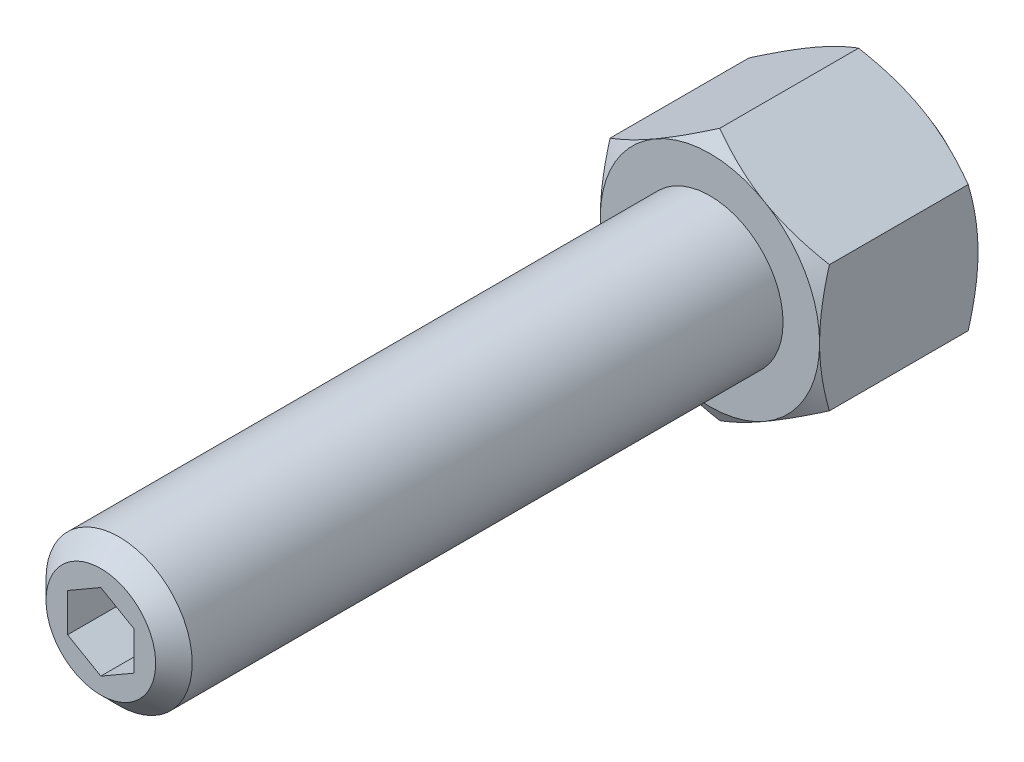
ISO-10303-21;
HEADER;
FILE_DESCRIPTION(('STEP AP214'),'2;1');
FILE_NAME('part.step','',(''),(''),'','','');
FILE_SCHEMA(('AUTOMOTIVE_DESIGN { 1 0 10303 214 1 1 1 1 }'));
ENDSEC;
DATA;
#1=APPLICATION_CONTEXT('core data for automotive mechanical design processes');
#2=APPLICATION_PROTOCOL_DEFINITION('international standard','automotive_design',2000,#1);
#3=PRODUCT_CONTEXT('',#1,'mechanical');
#4=PRODUCT('Part','Part','',(#3));
#5=PRODUCT_RELATED_PRODUCT_CATEGORY('part','',(#4));
#6=PRODUCT_DEFINITION_FORMATION('','',#4);
#7=PRODUCT_DEFINITION_CONTEXT('part definition',#1,'design');
#8=PRODUCT_DEFINITION('design','',#6,#7);
#9=PRODUCT_DEFINITION_SHAPE('','',#8);
#10=(LENGTH_UNIT() NAMED_UNIT(*) SI_UNIT(.MILLI.,.METRE.));
#11=(NAMED_UNIT(*) PLANE_ANGLE_UNIT() SI_UNIT($,.RADIAN.));
#12=(NAMED_UNIT(*) SI_UNIT($,.STERADIAN.) SOLID_ANGLE_UNIT());
#13=UNCERTAINTY_MEASURE_WITH_UNIT(LENGTH_MEASURE(1.E-05),#10,'distance_accuracy_value','');
#14=(GEOMETRIC_REPRESENTATION_CONTEXT(3) GLOBAL_UNCERTAINTY_ASSIGNED_CONTEXT((#13)) GLOBAL_UNIT_ASSIGNED_CONTEXT((#10,
#11,#12)) REPRESENTATION_CONTEXT('',''));
#15=CARTESIAN_POINT('',(0.,0.,0.));
#16=DIRECTION('',(0.,0.,1.));
#17=DIRECTION('',(1.,0.,0.));
#18=AXIS2_PLACEMENT_3D('',#15,#16,#17);
#19=CARTESIAN_POINT('',(1.00613961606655E-13,-20.7846096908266,160.));
#20=DIRECTION('',(-0.5,-0.866025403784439,0.));
#21=DIRECTION('',(-0.866025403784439,0.5,0.));
#22=AXIS2_PLACEMENT_3D('',#19,#20,#21);
#23=PLANE('',#22);
#24=DIRECTION('',(0.,0.,-1.));
#25=VECTOR('',#24,1.);
#26=CARTESIAN_POINT('',(-18.,-10.3923048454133,160.));
#27=LINE('',#26,#25);
#28=CARTESIAN_POINT('',(-18.,-10.3923048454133,28.3923048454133));
#29=VERTEX_POINT('',#28);
#30=CARTESIAN_POINT('',(-18.,-10.3923048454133,5.60769515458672));
#31=VERTEX_POINT('',#30);
#32=EDGE_CURVE('E170',#29,#31,#27,.T.);
#33=ORIENTED_EDGE('',*,*,#32,.T.);
#34=CARTESIAN_POINT('',(-18.0002,-10.3921893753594,5.60776182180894));
#35=CARTESIAN_POINT('',(-17.6045674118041,-10.6206079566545,5.47589336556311));
#36=CARTESIAN_POINT('',(-17.2073916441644,-10.8499174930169,5.35000889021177));
#37=CARTESIAN_POINT('',(-16.4098552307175,-11.310375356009,5.11187123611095));
#38=CARTESIAN_POINT('',(-16.0094935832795,-11.5415242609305,4.9996225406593));
#39=CARTESIAN_POINT('',(-15.2048116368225,-12.0061075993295,4.79026529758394));
#40=CARTESIAN_POINT('',(-14.8004842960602,-12.2395460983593,4.69319257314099));
#41=CARTESIAN_POINT('',(-13.9890201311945,-12.7080451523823,4.51627174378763));
#42=CARTESIAN_POINT('',(-13.5818834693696,-12.9431056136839,4.43642265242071));
#43=CARTESIAN_POINT('',(-12.7752328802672,-13.4088255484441,4.29734530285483));
#44=CARTESIAN_POINT('',(-12.3757788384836,-13.6394504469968,4.2376567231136));
#45=CARTESIAN_POINT('',(-11.5750403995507,-14.1017570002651,4.13757237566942));
#46=CARTESIAN_POINT('',(-11.1737559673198,-14.3334386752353,4.09717697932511));
#47=CARTESIAN_POINT('',(-10.3705130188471,-14.7971912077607,4.03669895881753));
#48=CARTESIAN_POINT('',(-9.96855587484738,-15.0292612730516,4.01659219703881));
#49=CARTESIAN_POINT('',(-9.16427056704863,-15.4936156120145,3.99712385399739));
#50=CARTESIAN_POINT('',(-8.76194241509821,-15.7258998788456,3.99776163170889));
#51=CARTESIAN_POINT('',(-8.00978065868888,-16.1601606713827,4.01833357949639));
#52=CARTESIAN_POINT('',(-7.65989346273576,-16.3621681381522,4.03575918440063));
#53=CARTESIAN_POINT('',(-6.96095368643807,-16.765701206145,4.08596906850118));
#54=CARTESIAN_POINT('',(-6.61190109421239,-16.9672268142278,4.11875312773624));
#55=CARTESIAN_POINT('',(-5.91476277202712,-17.3697198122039,4.19911105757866));
#56=CARTESIAN_POINT('',(-5.56667820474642,-17.5706865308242,4.2466983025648));
#57=CARTESIAN_POINT('',(-4.87216610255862,-17.9716632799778,4.35582287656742));
#58=CARTESIAN_POINT('',(-4.52573856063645,-18.1716733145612,4.41736014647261));
#59=CARTESIAN_POINT('',(-3.47411308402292,-18.7788295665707,4.62446207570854));
#60=CARTESIAN_POINT('',(-2.77196054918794,-19.1842175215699,4.79067746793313));
#61=CARTESIAN_POINT('',(-1.37812528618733,-19.9889486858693,5.16791817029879));
#62=CARTESIAN_POINT('',(-0.686424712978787,-20.3883021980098,5.37885488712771));
#63=CARTESIAN_POINT('',(0.000200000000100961,-20.7847251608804,5.60776182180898));
#64=B_SPLINE_CURVE_WITH_KNOTS('',3,(#34,#35,#36,#37,#38,#39,#40,#41,#42,#43,#44,#45,#46,#47,#48,
#49,#50,#51,#52,#53,#54,#55,#56,#57,#58,#59,#60,#61,#62,#63),.UNSPECIFIED.,.F.,.F.,(4,2,2,2,2,2,
2,2,2,2,2,2,2,2,4),(0.,1.42650335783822,2.85347447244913,4.28376471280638,5.71397301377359,
7.10888071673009,8.50381526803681,9.89708828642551,11.2903182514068,12.5031974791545,
13.7160593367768,14.9300201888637,16.1439758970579,18.6253607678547,21.1018751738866),.UNSPECIFIED.);
#65=CARTESIAN_POINT('',(-9.,-15.5884572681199,4.));
#66=VERTEX_POINT('',#65);
#67=EDGE_CURVE('E149',#31,#66,#64,.T.);
#68=ORIENTED_EDGE('',*,*,#67,.T.);
#69=CARTESIAN_POINT('',(1.0062978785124E-13,-20.7846096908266,5.60769515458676));
#70=VERTEX_POINT('',#69);
#71=EDGE_CURVE('E160',#66,#70,#64,.T.);
#72=ORIENTED_EDGE('',*,*,#71,.T.);
#73=DIRECTION('',(0.,0.,-1.));
#74=VECTOR('',#73,1.);
#75=CARTESIAN_POINT('',(1.00613961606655E-13,-20.7846096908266,160.));
#76=LINE('',#75,#74);
#77=CARTESIAN_POINT('',(1.00589838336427E-13,-20.7846096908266,28.3923048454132));
#78=VERTEX_POINT('',#77);
#79=EDGE_CURVE('E349',#78,#70,#76,.T.);
#80=ORIENTED_EDGE('',*,*,#79,.F.);
#81=CARTESIAN_POINT('',(0.000200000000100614,-20.7847251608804,28.3922381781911));
#82=CARTESIAN_POINT('',(-0.395432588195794,-20.5563065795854,28.5241066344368));
#83=CARTESIAN_POINT('',(-0.792608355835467,-20.326997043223,28.6499911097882));
#84=CARTESIAN_POINT('',(-1.59014476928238,-19.8665391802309,28.888128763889));
#85=CARTESIAN_POINT('',(-1.99050641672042,-19.6353902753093,29.0003774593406));
#86=CARTESIAN_POINT('',(-2.79518836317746,-19.1708069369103,29.209734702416));
#87=CARTESIAN_POINT('',(-3.1995157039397,-18.9373684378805,29.306807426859));
#88=CARTESIAN_POINT('',(-4.01097986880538,-18.4688693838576,29.4837282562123));
#89=CARTESIAN_POINT('',(-4.41811653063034,-18.233808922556,29.5635773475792));
#90=CARTESIAN_POINT('',(-5.22476711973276,-17.7680889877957,29.7026546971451));
#91=CARTESIAN_POINT('',(-5.62422116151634,-17.5374640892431,29.7623432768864));
#92=CARTESIAN_POINT('',(-6.42495960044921,-17.0751575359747,29.8624276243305));
#93=CARTESIAN_POINT('',(-6.82624403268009,-16.8434758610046,29.9028230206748));
#94=CARTESIAN_POINT('',(-7.62948698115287,-16.3797233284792,29.9633010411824));
#95=CARTESIAN_POINT('',(-8.03144412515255,-16.1476532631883,29.9834078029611));
#96=CARTESIAN_POINT('',(-8.8357294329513,-15.6832989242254,30.0028761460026));
#97=CARTESIAN_POINT('',(-9.23805758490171,-15.4510146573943,30.0022383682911));
#98=CARTESIAN_POINT('',(-9.99021934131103,-15.0167538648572,29.9816664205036));
#99=CARTESIAN_POINT('',(-10.3401065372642,-14.8147463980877,29.9642408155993));
#100=CARTESIAN_POINT('',(-11.0390463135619,-14.4112133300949,29.9140309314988));
#101=CARTESIAN_POINT('',(-11.3880989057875,-14.209687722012,29.8812468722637));
#102=CARTESIAN_POINT('',(-12.0852372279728,-13.807194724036,29.8008889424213));
#103=CARTESIAN_POINT('',(-12.4333217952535,-13.6062280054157,29.7533016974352));
#104=CARTESIAN_POINT('',(-13.1278338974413,-13.2052512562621,29.6441771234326));
#105=CARTESIAN_POINT('',(-13.4742614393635,-13.0052412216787,29.5826398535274));
#106=CARTESIAN_POINT('',(-14.525886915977,-12.3980849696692,29.3755379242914));
#107=CARTESIAN_POINT('',(-15.228039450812,-11.99269701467,29.2093225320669));
#108=CARTESIAN_POINT('',(-16.6218747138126,-11.1879658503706,28.8320818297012));
#109=CARTESIAN_POINT('',(-17.3135752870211,-10.7886123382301,28.6211451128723));
#110=CARTESIAN_POINT('',(-18.0002,-10.3921893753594,28.3922381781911));
#111=B_SPLINE_CURVE_WITH_KNOTS('',3,(#81,#82,#83,#84,#85,#86,#87,#88,#89,#90,#91,#92,#93,#94,
#95,#96,#97,#98,#99,#100,#101,#102,#103,#104,#105,#106,#107,#108,#109,#110),.UNSPECIFIED.,.F.,
.F.,(4,2,2,2,2,2,2,2,2,2,2,2,2,2,4),(0.,1.42650335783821,2.85347447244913,4.28376471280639,
5.7139730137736,7.1088807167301,8.50381526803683,9.89708828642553,11.2903182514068,
12.5031974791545,13.7160593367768,14.9300201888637,16.1439758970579,18.6253607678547,
21.1018751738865),.UNSPECIFIED.);
#112=CARTESIAN_POINT('',(-9.,-15.5884572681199,30.));
#113=VERTEX_POINT('',#112);
#114=EDGE_CURVE('E347',#78,#113,#111,.T.);
#115=ORIENTED_EDGE('',*,*,#114,.T.);
#116=EDGE_CURVE('E235',#113,#29,#111,.T.);
#117=ORIENTED_EDGE('',*,*,#116,.T.);
#118=EDGE_LOOP('',(#33,#68,#72,#80,#115,#117));
#119=FACE_BOUND('',#118,.T.);
#120=ADVANCED_FACE('F14',(#119),#23,.T.);
#121=CARTESIAN_POINT('',(-18.,-10.3923048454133,160.));
#122=DIRECTION('',(-1.,0.,0.));
#123=DIRECTION('',(0.,1.,0.));
#124=AXIS2_PLACEMENT_3D('',#121,#122,#123);
#125=PLANE('',#124);
#126=DIRECTION('',(0.,0.,-1.));
#127=VECTOR('',#126,1.);
#128=CARTESIAN_POINT('',(-18.,10.3923048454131,160.));
#129=LINE('',#128,#127);
#130=CARTESIAN_POINT('',(-18.,10.3923048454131,28.3923048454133));
#131=VERTEX_POINT('',#130);
#132=CARTESIAN_POINT('',(-18.,10.3923048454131,5.60769515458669));
#133=VERTEX_POINT('',#132);
#134=EDGE_CURVE('E306',#131,#133,#129,.T.);
#135=ORIENTED_EDGE('',*,*,#134,.T.);
#136=CARTESIAN_POINT('',(-18.,-27.9013754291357,12.777869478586));
#137=CARTESIAN_POINT('',(-18.,-27.5083653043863,12.5872034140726));
#138=CARTESIAN_POINT('',(-18.,-27.1148936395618,12.3974891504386));
#139=CARTESIAN_POINT('',(-18.,-26.3269309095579,12.020179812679));
#140=CARTESIAN_POINT('',(-18.,-25.9324398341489,11.8325847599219));
#141=CARTESIAN_POINT('',(-18.,-24.7471877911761,11.2732522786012));
#142=CARTESIAN_POINT('',(-18.,-23.9547644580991,10.9050241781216));
#143=CARTESIAN_POINT('',(-18.,-22.360291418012,10.1781698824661));
#144=CARTESIAN_POINT('',(-18.,-21.558212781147,9.81960699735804));
#145=CARTESIAN_POINT('',(-18.,-19.9476722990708,9.11716672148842));
#146=CARTESIAN_POINT('',(-18.,-19.1392107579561,8.77328863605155));
#147=CARTESIAN_POINT('',(-18.,-17.4885424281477,8.09336332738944));
#148=CARTESIAN_POINT('',(-18.,-16.6460850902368,7.75792119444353));
#149=CARTESIAN_POINT('',(-18.,-14.9513030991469,7.11245624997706));
#150=CARTESIAN_POINT('',(-18.,-14.0989773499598,6.80243629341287));
#151=CARTESIAN_POINT('',(-18.,-12.3847302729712,6.2159691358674));
#152=CARTESIAN_POINT('',(-18.,-11.5228324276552,5.93945384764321));
#153=CARTESIAN_POINT('',(-18.,-9.78659124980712,5.42886269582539));
#154=CARTESIAN_POINT('',(-18.,-8.91225193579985,5.19477345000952));
#155=CARTESIAN_POINT('',(-18.,-7.59368607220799,4.88457842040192));
#156=CARTESIAN_POINT('',(-18.,-7.1541970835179,4.78821098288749));
#157=CARTESIAN_POINT('',(-18.,-6.27221865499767,4.61027078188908));
#158=CARTESIAN_POINT('',(-18.,-5.82972927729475,4.52869771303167));
#159=CARTESIAN_POINT('',(-18.,-4.94206415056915,4.38178830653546));
#160=CARTESIAN_POINT('',(-18.,-4.49688848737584,4.31645145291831));
#161=CARTESIAN_POINT('',(-18.,-3.60429886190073,4.20331427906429));
#162=CARTESIAN_POINT('',(-18.,-3.15688490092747,4.15551394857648));
#163=CARTESIAN_POINT('',(-18.,-2.26630408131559,4.07900213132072));
#164=CARTESIAN_POINT('',(-18.,-1.82315806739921,4.05004949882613));
#165=CARTESIAN_POINT('',(-18.,-0.936039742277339,4.01090926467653));
#166=CARTESIAN_POINT('',(-18.,-0.492067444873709,4.00072135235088));
#167=CARTESIAN_POINT('',(-18.,0.395911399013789,3.99935278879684));
#168=CARTESIAN_POINT('',(-18.,0.839917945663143,4.00817223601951));
#169=CARTESIAN_POINT('',(-18.,1.72716407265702,4.04460362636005));
#170=CARTESIAN_POINT('',(-18.,2.17040361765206,4.07221641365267));
#171=CARTESIAN_POINT('',(-18.,3.2360768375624,4.16061335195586));
#172=CARTESIAN_POINT('',(-18.,3.85778189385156,4.2303381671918));
#173=CARTESIAN_POINT('',(-18.,5.09657247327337,4.40296101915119));
#174=CARTESIAN_POINT('',(-18.,5.71365735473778,4.5058635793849));
#175=CARTESIAN_POINT('',(-18.,6.9426218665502,4.74118125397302));
#176=CARTESIAN_POINT('',(-18.,7.55449703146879,4.87361946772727));
#177=CARTESIAN_POINT('',(-18.,8.77210659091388,5.16396753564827));
#178=CARTESIAN_POINT('',(-18.,9.37784107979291,5.32187699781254));
#179=CARTESIAN_POINT('',(-18.,10.5964430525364,5.66304485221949));
#180=CARTESIAN_POINT('',(-18.,11.209175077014,5.84678374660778));
#181=CARTESIAN_POINT('',(-18.,12.4286030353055,6.23320357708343));
#182=CARTESIAN_POINT('',(-18.,13.0352989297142,6.4358846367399));
#183=CARTESIAN_POINT('',(-18.,14.242954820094,6.85697441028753));
#184=CARTESIAN_POINT('',(-18.,14.8439166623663,7.07537785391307));
#185=CARTESIAN_POINT('',(-18.,16.0408638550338,7.52534714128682));
#186=CARTESIAN_POINT('',(-18.,16.6368492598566,7.75691284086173));
#187=CARTESIAN_POINT('',(-18.,18.0272150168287,8.31199066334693));
#188=CARTESIAN_POINT('',(-18.,18.8198387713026,8.63989572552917));
#189=CARTESIAN_POINT('',(-18.,20.3984598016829,9.31133112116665));
#190=CARTESIAN_POINT('',(-18.,21.1844566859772,9.6548623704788));
#191=CARTESIAN_POINT('',(-18.,22.7510353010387,10.3544677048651));
#192=CARTESIAN_POINT('',(-18.,23.5316158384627,10.7105444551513));
#193=CARTESIAN_POINT('',(-18.,25.0880830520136,11.4327483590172));
#194=CARTESIAN_POINT('',(-18.,25.86396982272,11.7988753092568));
#195=CARTESIAN_POINT('',(-18.,27.4126358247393,12.5397184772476));
#196=CARTESIAN_POINT('',(-18.,28.1854108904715,12.9144433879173));
#197=CARTESIAN_POINT('',(-18.,29.7276442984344,13.6706559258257));
#198=CARTESIAN_POINT('',(-18.,30.4971026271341,14.0521435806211));
#199=CARTESIAN_POINT('',(-18.,32.0331128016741,14.8206904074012));
#200=CARTESIAN_POINT('',(-18.,32.7996649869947,15.2077489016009));
#201=CARTESIAN_POINT('',(-18.,34.3303665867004,15.986580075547));
#202=CARTESIAN_POINT('',(-18.,35.0945160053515,16.3783527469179));
#203=CARTESIAN_POINT('',(-18.,37.2583873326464,17.4948686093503));
#204=CARTESIAN_POINT('',(-18.,38.6556824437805,18.2243150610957));
#205=CARTESIAN_POINT('',(-18.,41.4450416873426,19.6932316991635));
#206=CARTESIAN_POINT('',(-18.,42.8371056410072,20.4327022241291));
#207=CARTESIAN_POINT('',(-18.,45.6137450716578,21.9175318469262));
#208=CARTESIAN_POINT('',(-18.,46.9983305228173,22.6628723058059));
#209=CARTESIAN_POINT('',(-18.,49.0727327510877,23.7853649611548));
#210=CARTESIAN_POINT('',(-18.,49.7637693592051,24.1602662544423));
#211=CARTESIAN_POINT('',(-18.,51.1451096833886,24.9114141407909));
#212=CARTESIAN_POINT('',(-18.,51.8354134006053,25.2876607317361));
#213=CARTESIAN_POINT('',(-18.,52.5253918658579,25.6645030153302));
#214=B_SPLINE_CURVE_WITH_KNOTS('',3,(#136,#137,#138,#139,#140,#141,#142,#143,#144,#145,#146,
#147,#148,#149,#150,#151,#152,#153,#154,#155,#156,#157,#158,#159,#160,#161,#162,#163,#164,#165,
#166,#167,#168,#169,#170,#171,#172,#173,#174,#175,#176,#177,#178,#179,#180,#181,#182,#183,#184,
#185,#186,#187,#188,#189,#190,#191,#192,#193,#194,#195,#196,#197,#198,#199,#200,#201,#202,#203,
#204,#205,#206,#207,#208,#209,#210,#211,#212,#213),.UNSPECIFIED.,.F.,.F.,(4,2,2,2,2,2,2,2,2,2,2,
2,2,2,2,2,2,2,2,2,2,2,2,2,2,2,2,2,2,2,2,2,2,2,2,2,2,2,4),(0.,1.31045347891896,2.62092015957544,
5.2422419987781,7.87785820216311,10.5133495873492,13.2333859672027,15.9537273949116,
18.6684444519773,21.3823037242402,22.7318858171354,24.0814400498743,25.4309513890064,
26.7804619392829,28.1123480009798,29.4442120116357,30.7760829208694,32.1080136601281,
33.9837834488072,35.8598090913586,37.7373071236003,39.6147762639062,41.5334736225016,
43.4521834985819,45.3702531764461,47.2883018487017,49.8613945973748,52.434638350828,
55.0084321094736,57.5821738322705,60.1586436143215,62.7351238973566,65.3112933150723,
67.8874581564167,72.6161102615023,77.3449225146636,82.0622621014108,84.4208078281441,
86.7793498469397),.UNSPECIFIED.);
#215=CARTESIAN_POINT('',(-18.,0.,4.));
#216=VERTEX_POINT('',#215);
#217=EDGE_CURVE('E289',#133,#216,#214,.F.);
#218=ORIENTED_EDGE('',*,*,#217,.T.);
#219=EDGE_CURVE('E151',#216,#31,#214,.F.);
#220=ORIENTED_EDGE('',*,*,#219,.T.);
#221=ORIENTED_EDGE('',*,*,#32,.F.);
#222=CARTESIAN_POINT('',(-18.,-27.9013754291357,21.222130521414));
#223=CARTESIAN_POINT('',(-18.,-27.5083653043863,21.4127965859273));
#224=CARTESIAN_POINT('',(-18.,-27.1148936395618,21.6025108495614));
#225=CARTESIAN_POINT('',(-18.,-26.3269309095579,21.979820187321));
#226=CARTESIAN_POINT('',(-18.,-25.9324398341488,22.1674152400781));
#227=CARTESIAN_POINT('',(-18.,-24.7471877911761,22.7267477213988));
#228=CARTESIAN_POINT('',(-18.,-23.9547644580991,23.0949758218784));
#229=CARTESIAN_POINT('',(-18.,-22.360291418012,23.8218301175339));
#230=CARTESIAN_POINT('',(-18.,-21.5582127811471,24.1803930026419));
#231=CARTESIAN_POINT('',(-18.,-19.9476722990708,24.8828332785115));
#232=CARTESIAN_POINT('',(-18.,-19.1392107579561,25.2267113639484));
#233=CARTESIAN_POINT('',(-18.,-17.4885424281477,25.9066366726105));
#234=CARTESIAN_POINT('',(-18.,-16.6460850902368,26.2420788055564));
#235=CARTESIAN_POINT('',(-18.,-14.9513030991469,26.8875437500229));
#236=CARTESIAN_POINT('',(-18.,-14.0989773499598,27.1975637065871));
#237=CARTESIAN_POINT('',(-18.,-12.3847302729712,27.7840308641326));
#238=CARTESIAN_POINT('',(-18.,-11.5228324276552,28.0605461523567));
#239=CARTESIAN_POINT('',(-18.,-9.78659124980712,28.5711373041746));
#240=CARTESIAN_POINT('',(-18.,-8.91225193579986,28.8052265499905));
#241=CARTESIAN_POINT('',(-18.,-7.593686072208,29.1154215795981));
#242=CARTESIAN_POINT('',(-18.,-7.15419708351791,29.2117890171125));
#243=CARTESIAN_POINT('',(-18.,-6.27221865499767,29.3897292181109));
#244=CARTESIAN_POINT('',(-18.,-5.82972927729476,29.4713022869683));
#245=CARTESIAN_POINT('',(-18.,-4.94206415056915,29.6182116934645));
#246=CARTESIAN_POINT('',(-18.,-4.49688848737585,29.6835485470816));
#247=CARTESIAN_POINT('',(-18.,-3.60429886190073,29.7966857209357));
#248=CARTESIAN_POINT('',(-18.,-3.15688490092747,29.8444860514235));
#249=CARTESIAN_POINT('',(-18.,-2.26630408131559,29.9209978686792));
#250=CARTESIAN_POINT('',(-18.,-1.82315806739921,29.9499505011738));
#251=CARTESIAN_POINT('',(-18.,-0.936039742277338,29.9890907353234));
#252=CARTESIAN_POINT('',(-18.,-0.492067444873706,29.9992786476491));
#253=CARTESIAN_POINT('',(-18.,0.395911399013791,30.0006472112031));
#254=CARTESIAN_POINT('',(-18.,0.839917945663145,29.9918277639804));
#255=CARTESIAN_POINT('',(-18.,1.72716407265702,29.9553963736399));
#256=CARTESIAN_POINT('',(-18.,2.17040361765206,29.9277835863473));
#257=CARTESIAN_POINT('',(-18.,3.2360768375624,29.8393866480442));
#258=CARTESIAN_POINT('',(-18.,3.85778189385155,29.7696618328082));
#259=CARTESIAN_POINT('',(-18.,5.09657247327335,29.5970389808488));
#260=CARTESIAN_POINT('',(-18.,5.71365735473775,29.4941364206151));
#261=CARTESIAN_POINT('',(-18.,6.94262186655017,29.258818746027));
#262=CARTESIAN_POINT('',(-18.,7.55449703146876,29.1263805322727));
#263=CARTESIAN_POINT('',(-18.,8.77210659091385,28.8360324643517));
#264=CARTESIAN_POINT('',(-18.,9.37784107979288,28.6781230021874));
#265=CARTESIAN_POINT('',(-18.,10.5964430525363,28.3369551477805));
#266=CARTESIAN_POINT('',(-18.,11.209175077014,28.1532162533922));
#267=CARTESIAN_POINT('',(-18.,12.4286030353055,27.7667964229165));
#268=CARTESIAN_POINT('',(-18.,13.0352989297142,27.5641153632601));
#269=CARTESIAN_POINT('',(-18.,14.242954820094,27.1430255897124));
#270=CARTESIAN_POINT('',(-18.,14.8439166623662,26.9246221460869));
#271=CARTESIAN_POINT('',(-18.,16.0408638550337,26.4746528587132));
#272=CARTESIAN_POINT('',(-18.,16.6368492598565,26.2430871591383));
#273=CARTESIAN_POINT('',(-18.,18.0272150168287,25.6880093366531));
#274=CARTESIAN_POINT('',(-18.,18.8198387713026,25.3601042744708));
#275=CARTESIAN_POINT('',(-18.,20.3984598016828,24.6886688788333));
#276=CARTESIAN_POINT('',(-18.,21.1844566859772,24.3451376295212));
#277=CARTESIAN_POINT('',(-18.,22.7510353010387,23.6455322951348));
#278=CARTESIAN_POINT('',(-18.,23.5316158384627,23.2894555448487));
#279=CARTESIAN_POINT('',(-18.,25.0880830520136,22.5672516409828));
#280=CARTESIAN_POINT('',(-18.,25.86396982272,22.2011246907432));
#281=CARTESIAN_POINT('',(-18.,27.4126358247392,21.4602815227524));
#282=CARTESIAN_POINT('',(-18.,28.1854108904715,21.0855566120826));
#283=CARTESIAN_POINT('',(-18.,29.7276442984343,20.3293440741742));
#284=CARTESIAN_POINT('',(-18.,30.497102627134,19.9478564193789));
#285=CARTESIAN_POINT('',(-18.,32.0331128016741,19.1793095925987));
#286=CARTESIAN_POINT('',(-18.,32.7996649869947,18.7922510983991));
#287=CARTESIAN_POINT('',(-18.,34.3303665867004,18.013419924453));
#288=CARTESIAN_POINT('',(-18.,35.0945160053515,17.6216472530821));
#289=CARTESIAN_POINT('',(-18.,37.2583873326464,16.5051313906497));
#290=CARTESIAN_POINT('',(-18.,38.6556824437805,15.7756849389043));
#291=CARTESIAN_POINT('',(-18.,41.4450416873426,14.3067683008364));
#292=CARTESIAN_POINT('',(-18.,42.8371056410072,13.5672977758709));
#293=CARTESIAN_POINT('',(-18.,45.6137450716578,12.0824681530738));
#294=CARTESIAN_POINT('',(-18.,46.9983305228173,11.3371276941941));
#295=CARTESIAN_POINT('',(-18.,49.0727327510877,10.2146350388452));
#296=CARTESIAN_POINT('',(-18.,49.763769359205,9.83973374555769));
#297=CARTESIAN_POINT('',(-18.,51.1451096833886,9.08858585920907));
#298=CARTESIAN_POINT('',(-18.,51.8354134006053,8.71233926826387));
#299=CARTESIAN_POINT('',(-18.,52.5253918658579,8.3354969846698));
#300=B_SPLINE_CURVE_WITH_KNOTS('',3,(#222,#223,#224,#225,#226,#227,#228,#229,#230,#231,#232,
#233,#234,#235,#236,#237,#238,#239,#240,#241,#242,#243,#244,#245,#246,#247,#248,#249,#250,#251,
#252,#253,#254,#255,#256,#257,#258,#259,#260,#261,#262,#263,#264,#265,#266,#267,#268,#269,#270,
#271,#272,#273,#274,#275,#276,#277,#278,#279,#280,#281,#282,#283,#284,#285,#286,#287,#288,#289,
#290,#291,#292,#293,#294,#295,#296,#297,#298,#299),.UNSPECIFIED.,.F.,.F.,(4,2,2,2,2,2,2,2,2,2,2,
2,2,2,2,2,2,2,2,2,2,2,2,2,2,2,2,2,2,2,2,2,2,2,2,2,2,2,4),(0.,1.31045347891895,2.62092015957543,
5.24224199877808,7.87785820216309,10.5133495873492,13.2333859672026,15.9537273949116,
18.6684444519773,21.3823037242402,22.7318858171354,24.0814400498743,25.4309513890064,
26.7804619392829,28.1123480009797,29.4442120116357,30.7760829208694,32.1080136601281,
33.9837834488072,35.8598090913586,37.7373071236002,39.6147762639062,41.5334736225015,
43.4521834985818,45.370253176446,47.2883018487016,49.8613945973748,52.4346383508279,
55.0084321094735,57.5821738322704,60.1586436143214,62.7351238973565,65.3112933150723,
67.8874581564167,72.6161102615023,77.3449225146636,82.0622621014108,84.4208078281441,
86.7793498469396),.UNSPECIFIED.);
#301=CARTESIAN_POINT('',(-18.,0.,30.));
#302=VERTEX_POINT('',#301);
#303=EDGE_CURVE('E245',#29,#302,#300,.T.);
#304=ORIENTED_EDGE('',*,*,#303,.T.);
#305=EDGE_CURVE('E265',#302,#131,#300,.T.);
#306=ORIENTED_EDGE('',*,*,#305,.T.);
#307=EDGE_LOOP('',(#135,#218,#220,#221,#304,#306));
#308=FACE_BOUND('',#307,.T.);
#309=ADVANCED_FACE('F269',(#308),#125,.T.);
#310=CARTESIAN_POINT('',(-1.07552855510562E-13,20.7846096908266,160.));
#311=DIRECTION('',(0.500000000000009,-0.866025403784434,0.));
#312=DIRECTION('',(-0.866025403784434,-0.500000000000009,0.));
#313=AXIS2_PLACEMENT_3D('',#310,#311,#312);
#314=PLANE('',#313);
#315=CARTESIAN_POINT('',(-18.0002,10.3921893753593,5.6077618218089));
#316=CARTESIAN_POINT('',(-17.6045674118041,10.6206079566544,5.47589336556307));
#317=CARTESIAN_POINT('',(-17.2073916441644,10.8499174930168,5.35000889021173));
#318=CARTESIAN_POINT('',(-16.4098552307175,11.3103753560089,5.11187123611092));
#319=CARTESIAN_POINT('',(-16.0094935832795,11.5415242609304,4.99962254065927));
#320=CARTESIAN_POINT('',(-15.2048116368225,12.0061075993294,4.79026529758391));
#321=CARTESIAN_POINT('',(-14.8004842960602,12.2395460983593,4.69319257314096));
#322=CARTESIAN_POINT('',(-13.9890201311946,12.7080451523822,4.51627174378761));
#323=CARTESIAN_POINT('',(-13.5818834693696,12.9431056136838,4.43642265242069));
#324=CARTESIAN_POINT('',(-12.7752328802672,13.4088255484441,4.29734530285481));
#325=CARTESIAN_POINT('',(-12.3757788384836,13.6394504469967,4.23765672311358));
#326=CARTESIAN_POINT('',(-11.5750403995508,14.1017570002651,4.13757237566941));
#327=CARTESIAN_POINT('',(-11.1737559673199,14.3334386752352,4.0971769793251));
#328=CARTESIAN_POINT('',(-10.3705130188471,14.7971912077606,4.03669895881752));
#329=CARTESIAN_POINT('',(-9.96855587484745,15.0292612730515,4.0165921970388));
#330=CARTESIAN_POINT('',(-9.1642705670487,15.4936156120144,3.99712385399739));
#331=CARTESIAN_POINT('',(-8.76194241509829,15.7258998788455,3.99776163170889));
#332=CARTESIAN_POINT('',(-8.00978065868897,16.1601606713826,4.01833357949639));
#333=CARTESIAN_POINT('',(-7.65989346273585,16.3621681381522,4.03575918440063));
#334=CARTESIAN_POINT('',(-6.96095368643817,16.765701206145,4.08596906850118));
#335=CARTESIAN_POINT('',(-6.6119010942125,16.9672268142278,4.11875312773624));
#336=CARTESIAN_POINT('',(-5.91476277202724,17.3697198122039,4.19911105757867));
#337=CARTESIAN_POINT('',(-5.56667820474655,17.5706865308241,4.24669830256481));
#338=CARTESIAN_POINT('',(-4.87216610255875,17.9716632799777,4.35582287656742));
#339=CARTESIAN_POINT('',(-4.52573856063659,18.1716733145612,4.41736014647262));
#340=CARTESIAN_POINT('',(-3.47411308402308,18.7788295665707,4.62446207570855));
#341=CARTESIAN_POINT('',(-2.7719605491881,19.1842175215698,4.79067746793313));
#342=CARTESIAN_POINT('',(-1.37812528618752,19.9889486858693,5.1679181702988));
#343=CARTESIAN_POINT('',(-0.686424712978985,20.3883021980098,5.37885488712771));
#344=CARTESIAN_POINT('',(0.000199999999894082,20.7847251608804,5.60776182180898));
#345=B_SPLINE_CURVE_WITH_KNOTS('',3,(#315,#316,#317,#318,#319,#320,#321,#322,#323,#324,#325,
#326,#327,#328,#329,#330,#331,#332,#333,#334,#335,#336,#337,#338,#339,#340,#341,#342,#343,#344),
.UNSPECIFIED.,.F.,.F.,(4,2,2,2,2,2,2,2,2,2,2,2,2,2,4),(0.,1.42650335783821,2.85347447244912,
4.28376471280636,5.71397301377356,7.10888071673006,8.50381526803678,9.89708828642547,
11.2903182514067,12.5031974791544,13.7160593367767,14.9300201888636,16.1439758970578,
18.6253607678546,21.1018751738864),.UNSPECIFIED.);
#346=CARTESIAN_POINT('',(-9.00000000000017,15.5884572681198,4.));
#347=VERTEX_POINT('',#346);
#348=EDGE_CURVE('E280',#133,#347,#345,.T.);
#349=ORIENTED_EDGE('',*,*,#348,.F.);
#350=ORIENTED_EDGE('',*,*,#134,.F.);
#351=CARTESIAN_POINT('',(0.000199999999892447,20.7847251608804,28.3922381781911));
#352=CARTESIAN_POINT('',(-0.395432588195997,20.5563065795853,28.5241066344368));
#353=CARTESIAN_POINT('',(-0.792608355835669,20.326997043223,28.6499911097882));
#354=CARTESIAN_POINT('',(-1.59014476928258,19.8665391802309,28.888128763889));
#355=CARTESIAN_POINT('',(-1.99050641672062,19.6353902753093,29.0003774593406));
#356=CARTESIAN_POINT('',(-2.79518836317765,19.1708069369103,29.209734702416));
#357=CARTESIAN_POINT('',(-3.19951570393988,18.9373684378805,29.306807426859));
#358=CARTESIAN_POINT('',(-4.01097986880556,18.4688693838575,29.4837282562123));
#359=CARTESIAN_POINT('',(-4.41811653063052,18.2338089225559,29.5635773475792));
#360=CARTESIAN_POINT('',(-5.22476711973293,17.7680889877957,29.7026546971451));
#361=CARTESIAN_POINT('',(-5.62422116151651,17.537464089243,29.7623432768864));
#362=CARTESIAN_POINT('',(-6.42495960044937,17.0751575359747,29.8624276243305));
#363=CARTESIAN_POINT('',(-6.82624403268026,16.8434758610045,29.9028230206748));
#364=CARTESIAN_POINT('',(-7.62948698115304,16.3797233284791,29.9633010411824));
#365=CARTESIAN_POINT('',(-8.03144412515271,16.1476532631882,29.9834078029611));
#366=CARTESIAN_POINT('',(-8.83572943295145,15.6832989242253,30.0028761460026));
#367=CARTESIAN_POINT('',(-9.23805758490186,15.4510146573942,30.0022383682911));
#368=CARTESIAN_POINT('',(-9.99021934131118,15.0167538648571,29.9816664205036));
#369=CARTESIAN_POINT('',(-10.3401065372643,14.8147463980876,29.9642408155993));
#370=CARTESIAN_POINT('',(-11.039046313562,14.4112133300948,29.9140309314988));
#371=CARTESIAN_POINT('',(-11.3880989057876,14.2096877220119,29.8812468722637));
#372=CARTESIAN_POINT('',(-12.0852372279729,13.8071947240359,29.8008889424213));
#373=CARTESIAN_POINT('',(-12.4333217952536,13.6062280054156,29.7533016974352));
#374=CARTESIAN_POINT('',(-13.1278338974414,13.205251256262,29.6441771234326));
#375=CARTESIAN_POINT('',(-13.4742614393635,13.0052412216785,29.5826398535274));
#376=CARTESIAN_POINT('',(-14.525886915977,12.3980849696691,29.3755379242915));
#377=CARTESIAN_POINT('',(-15.228039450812,11.9926970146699,29.2093225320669));
#378=CARTESIAN_POINT('',(-16.6218747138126,11.1879658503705,28.8320818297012));
#379=CARTESIAN_POINT('',(-17.3135752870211,10.7886123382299,28.6211451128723));
#380=CARTESIAN_POINT('',(-18.0002,10.3921893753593,28.3922381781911));
#381=B_SPLINE_CURVE_WITH_KNOTS('',3,(#351,#352,#353,#354,#355,#356,#357,#358,#359,#360,#361,
#362,#363,#364,#365,#366,#367,#368,#369,#370,#371,#372,#373,#374,#375,#376,#377,#378,#379,#380),
.UNSPECIFIED.,.F.,.F.,(4,2,2,2,2,2,2,2,2,2,2,2,2,2,4),(0.,1.42650335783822,2.85347447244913,
4.28376471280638,5.71397301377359,7.1088807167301,8.50381526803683,9.89708828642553,
11.2903182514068,12.5031974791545,13.7160593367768,14.9300201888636,16.1439758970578,
18.6253607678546,21.1018751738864),.UNSPECIFIED.);
#382=CARTESIAN_POINT('',(-9.00000000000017,15.5884572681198,30.));
#383=VERTEX_POINT('',#382);
#384=EDGE_CURVE('E259',#383,#131,#381,.T.);
#385=ORIENTED_EDGE('',*,*,#384,.F.);
#386=CARTESIAN_POINT('',(-1.07576978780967E-13,20.7846096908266,28.3923048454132));
#387=VERTEX_POINT('',#386);
#388=EDGE_CURVE('E264',#387,#383,#381,.T.);
#389=ORIENTED_EDGE('',*,*,#388,.F.);
#390=DIRECTION('',(0.,0.,-1.));
#391=VECTOR('',#390,1.);
#392=CARTESIAN_POINT('',(-1.07552855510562E-13,20.7846096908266,160.));
#393=LINE('',#392,#391);
#394=CARTESIAN_POINT('',(-1.07475099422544E-13,20.7846096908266,5.60769515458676));
#395=VERTEX_POINT('',#394);
#396=EDGE_CURVE('E314',#387,#395,#393,.T.);
#397=ORIENTED_EDGE('',*,*,#396,.T.);
#398=EDGE_CURVE('E274',#347,#395,#345,.T.);
#399=ORIENTED_EDGE('',*,*,#398,.F.);
#400=EDGE_LOOP('',(#349,#350,#385,#389,#397,#399));
#401=FACE_BOUND('',#400,.T.);
#402=ADVANCED_FACE('F266',(#401),#314,.F.);
#403=CARTESIAN_POINT('',(-1.07552855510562E-13,20.7846096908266,160.));
#404=DIRECTION('',(0.5,0.866025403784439,0.));
#405=DIRECTION('',(0.866025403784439,-0.5,0.));
#406=AXIS2_PLACEMENT_3D('',#403,#404,#405);
#407=PLANE('',#406);
#408=DIRECTION('',(0.,0.,-1.));
#409=VECTOR('',#408,1.);
#410=CARTESIAN_POINT('',(18.,10.3923048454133,160.));
#411=LINE('',#410,#409);
#412=CARTESIAN_POINT('',(18.,10.3923048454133,28.3923048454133));
#413=VERTEX_POINT('',#412);
#414=CARTESIAN_POINT('',(18.,10.3923048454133,5.60769515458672));
#415=VERTEX_POINT('',#414);
#416=EDGE_CURVE('E326',#413,#415,#411,.T.);
#417=ORIENTED_EDGE('',*,*,#416,.T.);
#418=CARTESIAN_POINT('',(18.0002,10.3921893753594,5.60776182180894));
#419=CARTESIAN_POINT('',(17.6045674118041,10.6206079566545,5.4758933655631));
#420=CARTESIAN_POINT('',(17.2073916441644,10.8499174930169,5.35000889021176));
#421=CARTESIAN_POINT('',(16.4098552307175,11.310375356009,5.11187123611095));
#422=CARTESIAN_POINT('',(16.0094935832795,11.5415242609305,4.9996225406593));
#423=CARTESIAN_POINT('',(15.2048116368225,12.0061075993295,4.79026529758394));
#424=CARTESIAN_POINT('',(14.8004842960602,12.2395460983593,4.69319257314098));
#425=CARTESIAN_POINT('',(13.9890201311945,12.7080451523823,4.51627174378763));
#426=CARTESIAN_POINT('',(13.5818834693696,12.9431056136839,4.43642265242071));
#427=CARTESIAN_POINT('',(12.7752328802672,13.4088255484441,4.29734530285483));
#428=CARTESIAN_POINT('',(12.3757788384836,13.6394504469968,4.23765672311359));
#429=CARTESIAN_POINT('',(11.5750403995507,14.1017570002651,4.13757237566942));
#430=CARTESIAN_POINT('',(11.1737559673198,14.3334386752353,4.09717697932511));
#431=CARTESIAN_POINT('',(10.3705130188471,14.7971912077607,4.03669895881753));
#432=CARTESIAN_POINT('',(9.96855587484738,15.0292612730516,4.01659219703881));
#433=CARTESIAN_POINT('',(9.16427056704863,15.4936156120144,3.99712385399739));
#434=CARTESIAN_POINT('',(8.76194241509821,15.7258998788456,3.99776163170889));
#435=CARTESIAN_POINT('',(8.00978065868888,16.1601606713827,4.01833357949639));
#436=CARTESIAN_POINT('',(7.65989346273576,16.3621681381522,4.03575918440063));
#437=CARTESIAN_POINT('',(6.96095368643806,16.765701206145,4.08596906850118));
#438=CARTESIAN_POINT('',(6.61190109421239,16.9672268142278,4.11875312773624));
#439=CARTESIAN_POINT('',(5.91476277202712,17.3697198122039,4.19911105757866));
#440=CARTESIAN_POINT('',(5.56667820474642,17.5706865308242,4.2466983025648));
#441=CARTESIAN_POINT('',(4.87216610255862,17.9716632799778,4.35582287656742));
#442=CARTESIAN_POINT('',(4.52573856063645,18.1716733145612,4.41736014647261));
#443=CARTESIAN_POINT('',(3.47411308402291,18.7788295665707,4.62446207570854));
#444=CARTESIAN_POINT('',(2.77196054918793,19.1842175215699,4.79067746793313));
#445=CARTESIAN_POINT('',(1.37812528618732,19.9889486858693,5.16791817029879));
#446=CARTESIAN_POINT('',(0.686424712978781,20.3883021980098,5.37885488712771));
#447=CARTESIAN_POINT('',(-0.000200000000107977,20.7847251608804,5.60776182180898));
#448=B_SPLINE_CURVE_WITH_KNOTS('',3,(#418,#419,#420,#421,#422,#423,#424,#425,#426,#427,#428,
#429,#430,#431,#432,#433,#434,#435,#436,#437,#438,#439,#440,#441,#442,#443,#444,#445,#446,#447),
.UNSPECIFIED.,.F.,.F.,(4,2,2,2,2,2,2,2,2,2,2,2,2,2,4),(0.,1.42650335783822,2.85347447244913,
4.28376471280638,5.71397301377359,7.10888071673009,8.50381526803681,9.8970882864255,
11.2903182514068,12.5031974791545,13.7160593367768,14.9300201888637,16.1439758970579,
18.6253607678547,21.1018751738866),.UNSPECIFIED.);
#449=CARTESIAN_POINT('',(9.,15.5884572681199,4.));
#450=VERTEX_POINT('',#449);
#451=EDGE_CURVE('E165',#415,#450,#448,.T.);
#452=ORIENTED_EDGE('',*,*,#451,.T.);
#453=EDGE_CURVE('E171',#450,#395,#448,.T.);
#454=ORIENTED_EDGE('',*,*,#453,.T.);
#455=ORIENTED_EDGE('',*,*,#396,.F.);
#456=CARTESIAN_POINT('',(-0.000200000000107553,20.7847251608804,28.3922381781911));
#457=CARTESIAN_POINT('',(0.395432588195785,20.5563065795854,28.5241066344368));
#458=CARTESIAN_POINT('',(0.792608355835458,20.326997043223,28.6499911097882));
#459=CARTESIAN_POINT('',(1.59014476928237,19.8665391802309,28.888128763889));
#460=CARTESIAN_POINT('',(1.99050641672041,19.6353902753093,29.0003774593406));
#461=CARTESIAN_POINT('',(2.79518836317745,19.1708069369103,29.209734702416));
#462=CARTESIAN_POINT('',(3.19951570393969,18.9373684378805,29.306807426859));
#463=CARTESIAN_POINT('',(4.01097986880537,18.4688693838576,29.4837282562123));
#464=CARTESIAN_POINT('',(4.41811653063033,18.233808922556,29.5635773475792));
#465=CARTESIAN_POINT('',(5.22476711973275,17.7680889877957,29.7026546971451));
#466=CARTESIAN_POINT('',(5.62422116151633,17.5374640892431,29.7623432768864));
#467=CARTESIAN_POINT('',(6.4249596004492,17.0751575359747,29.8624276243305));
#468=CARTESIAN_POINT('',(6.82624403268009,16.8434758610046,29.9028230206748));
#469=CARTESIAN_POINT('',(7.62948698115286,16.3797233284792,29.9633010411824));
#470=CARTESIAN_POINT('',(8.03144412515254,16.1476532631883,29.9834078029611));
#471=CARTESIAN_POINT('',(8.83572943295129,15.6832989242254,30.0028761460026));
#472=CARTESIAN_POINT('',(9.2380575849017,15.4510146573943,30.0022383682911));
#473=CARTESIAN_POINT('',(9.99021934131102,15.0167538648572,29.9816664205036));
#474=CARTESIAN_POINT('',(10.3401065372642,14.8147463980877,29.9642408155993));
#475=CARTESIAN_POINT('',(11.0390463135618,14.4112133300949,29.9140309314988));
#476=CARTESIAN_POINT('',(11.3880989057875,14.209687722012,29.8812468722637));
#477=CARTESIAN_POINT('',(12.0852372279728,13.807194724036,29.8008889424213));
#478=CARTESIAN_POINT('',(12.4333217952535,13.6062280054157,29.7533016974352));
#479=CARTESIAN_POINT('',(13.1278338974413,13.2052512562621,29.6441771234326));
#480=CARTESIAN_POINT('',(13.4742614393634,13.0052412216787,29.5826398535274));
#481=CARTESIAN_POINT('',(14.525886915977,12.3980849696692,29.3755379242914));
#482=CARTESIAN_POINT('',(15.228039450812,11.99269701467,29.2093225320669));
#483=CARTESIAN_POINT('',(16.6218747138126,11.1879658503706,28.8320818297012));
#484=CARTESIAN_POINT('',(17.3135752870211,10.7886123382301,28.6211451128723));
#485=CARTESIAN_POINT('',(18.0002,10.3921893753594,28.3922381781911));
#486=B_SPLINE_CURVE_WITH_KNOTS('',3,(#456,#457,#458,#459,#460,#461,#462,#463,#464,#465,#466,
#467,#468,#469,#470,#471,#472,#473,#474,#475,#476,#477,#478,#479,#480,#481,#482,#483,#484,#485),
.UNSPECIFIED.,.F.,.F.,(4,2,2,2,2,2,2,2,2,2,2,2,2,2,4),(0.,1.42650335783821,2.85347447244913,
4.28376471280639,5.7139730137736,7.10888071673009,8.50381526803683,9.89708828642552,
11.2903182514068,12.5031974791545,13.7160593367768,14.9300201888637,16.1439758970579,
18.6253607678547,21.1018751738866),.UNSPECIFIED.);
#487=CARTESIAN_POINT('',(9.,15.5884572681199,30.));
#488=VERTEX_POINT('',#487);
#489=EDGE_CURVE('E215',#387,#488,#486,.T.);
#490=ORIENTED_EDGE('',*,*,#489,.T.);
#491=EDGE_CURVE('E214',#488,#413,#486,.T.);
#492=ORIENTED_EDGE('',*,*,#491,.T.);
#493=EDGE_LOOP('',(#417,#452,#454,#455,#490,#492));
#494=FACE_BOUND('',#493,.T.);
#495=ADVANCED_FACE('F199',(#494),#407,.T.);
#496=CARTESIAN_POINT('',(18.,-10.3923048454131,160.));
#497=DIRECTION('',(-1.,0.,0.));
#498=DIRECTION('',(0.,1.,0.));
#499=AXIS2_PLACEMENT_3D('',#496,#497,#498);
#500=PLANE('',#499);
#501=CARTESIAN_POINT('',(18.,-27.9013754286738,12.7778694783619));
#502=CARTESIAN_POINT('',(18.,-27.5083653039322,12.5872034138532));
#503=CARTESIAN_POINT('',(18.,-27.1148936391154,12.3974891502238));
#504=CARTESIAN_POINT('',(18.,-26.3269309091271,12.0201798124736));
#505=CARTESIAN_POINT('',(18.,-25.9324398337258,11.8325847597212));
#506=CARTESIAN_POINT('',(18.,-24.7471877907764,11.2732522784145));
#507=CARTESIAN_POINT('',(18.,-23.9547644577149,10.9050241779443));
#508=CARTESIAN_POINT('',(18.,-22.3602914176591,10.1781698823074));
#509=CARTESIAN_POINT('',(18.,-21.55821278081,9.81960699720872));
#510=CARTESIAN_POINT('',(18.,-19.9476722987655,9.1171667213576));
#511=CARTESIAN_POINT('',(18.,-19.1392107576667,8.77328863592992));
#512=CARTESIAN_POINT('',(18.,-17.4885424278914,8.09336332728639));
#513=CARTESIAN_POINT('',(18.,-16.6460850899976,7.75792119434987));
#514=CARTESIAN_POINT('',(18.,-14.9513030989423,7.11245624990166));
#515=CARTESIAN_POINT('',(18.,-14.0989773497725,6.80243629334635));
#516=CARTESIAN_POINT('',(18.,-12.384730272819,6.21596913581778));
#517=CARTESIAN_POINT('',(18.,-11.5228324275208,5.9394538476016));
#518=CARTESIAN_POINT('',(18.,-9.7865912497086,5.42886269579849));
#519=CARTESIAN_POINT('',(18.,-8.91225193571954,5.1947734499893));
#520=CARTESIAN_POINT('',(18.,-7.59368607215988,4.88457842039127));
#521=CARTESIAN_POINT('',(18.,-7.15419708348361,4.78821098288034));
#522=CARTESIAN_POINT('',(18.,-6.2722186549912,4.61027078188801));
#523=CARTESIAN_POINT('',(18.,-5.82972927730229,4.52869771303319));
#524=CARTESIAN_POINT('',(18.,-4.94206415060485,4.3817883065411));
#525=CARTESIAN_POINT('',(18.,-4.4968884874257,4.31645145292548));
#526=CARTESIAN_POINT('',(18.,-3.60429886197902,4.20331427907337));
#527=CARTESIAN_POINT('',(18.,-3.15688490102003,4.15551394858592));
#528=CARTESIAN_POINT('',(18.,-2.2663040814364,4.07900213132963));
#529=CARTESIAN_POINT('',(18.,-1.82315806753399,4.05004949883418));
#530=CARTESIAN_POINT('',(18.,-0.936039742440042,4.01090926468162));
#531=CARTESIAN_POINT('',(18.,-0.492067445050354,4.00072135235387));
#532=CARTESIAN_POINT('',(18.,0.395911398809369,3.99935278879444));
#533=CARTESIAN_POINT('',(18.,0.83991794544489,4.00817223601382));
#534=CARTESIAN_POINT('',(18.,1.72716407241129,4.04460362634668));
#535=CARTESIAN_POINT('',(18.,2.17040361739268,4.07221641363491));
#536=CARTESIAN_POINT('',(18.,3.23607683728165,4.16061335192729));
#537=CARTESIAN_POINT('',(18.,3.85778189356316,4.23033816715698));
#538=CARTESIAN_POINT('',(18.,5.09657247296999,4.40296101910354));
#539=CARTESIAN_POINT('',(18.,5.71365735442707,4.50586357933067));
#540=CARTESIAN_POINT('',(18.,6.94262186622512,4.74118125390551));
#541=CARTESIAN_POINT('',(18.,7.55449703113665,4.87361946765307));
#542=CARTESIAN_POINT('',(18.,8.77210659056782,5.16396753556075));
#543=CARTESIAN_POINT('',(18.,9.37784107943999,5.32187699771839));
#544=CARTESIAN_POINT('',(18.,10.5964430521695,5.66304485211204));
#545=CARTESIAN_POINT('',(18.,11.2091750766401,5.84678374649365));
#546=CARTESIAN_POINT('',(18.,12.4286030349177,6.23320357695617));
#547=CARTESIAN_POINT('',(18.,13.0352989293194,6.43588463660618));
#548=CARTESIAN_POINT('',(18.,14.2429548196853,6.85697441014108));
#549=CARTESIAN_POINT('',(18.,14.8439166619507,7.07537785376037));
#550=CARTESIAN_POINT('',(18.,16.0408638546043,7.52534714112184));
#551=CARTESIAN_POINT('',(18.,16.6368492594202,7.75691284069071));
#552=CARTESIAN_POINT('',(18.,18.0272150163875,8.31199066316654));
#553=CARTESIAN_POINT('',(18.,18.8198387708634,8.63989572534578));
#554=CARTESIAN_POINT('',(18.,20.3984598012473,9.31133112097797));
#555=CARTESIAN_POINT('',(18.,21.1844566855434,9.65486237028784));
#556=CARTESIAN_POINT('',(18.,22.7510353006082,10.3544677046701));
#557=CARTESIAN_POINT('',(18.,23.5316158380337,10.7105444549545));
#558=CARTESIAN_POINT('',(18.,25.0880830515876,11.4327483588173));
#559=CARTESIAN_POINT('',(18.,25.8639698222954,11.7988753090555));
#560=CARTESIAN_POINT('',(18.,27.4126358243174,12.5397184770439));
#561=CARTESIAN_POINT('',(18.,28.185410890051,12.9144433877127));
#562=CARTESIAN_POINT('',(18.,29.7276442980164,13.6706559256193));
#563=CARTESIAN_POINT('',(18.,30.4971026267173,14.0521435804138));
#564=CARTESIAN_POINT('',(18.,32.0331128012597,14.8206904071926));
#565=CARTESIAN_POINT('',(18.,32.7996649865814,15.2077489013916));
#566=CARTESIAN_POINT('',(18.,34.3303665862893,15.9865800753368));
#567=CARTESIAN_POINT('',(18.,35.0945160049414,16.3783527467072));
#568=CARTESIAN_POINT('',(18.,37.2583873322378,17.4948686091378));
#569=CARTESIAN_POINT('',(18.,38.6556824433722,18.2243150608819));
#570=CARTESIAN_POINT('',(18.,41.4450416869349,19.6932316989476));
#571=CARTESIAN_POINT('',(18.,42.8371056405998,20.4327022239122));
#572=CARTESIAN_POINT('',(18.,45.6137450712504,21.9175318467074));
#573=CARTESIAN_POINT('',(18.,46.9983305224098,22.6628723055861));
#574=CARTESIAN_POINT('',(18.,49.07273275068,23.7853649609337));
#575=CARTESIAN_POINT('',(18.,49.7637693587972,24.1602662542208));
#576=CARTESIAN_POINT('',(18.,51.1451096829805,24.9114141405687));
#577=CARTESIAN_POINT('',(18.,51.8354134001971,25.2876607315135));
#578=CARTESIAN_POINT('',(18.,52.5253918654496,25.6645030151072));
#579=B_SPLINE_CURVE_WITH_KNOTS('',3,(#501,#502,#503,#504,#505,#506,#507,#508,#509,#510,#511,
#512,#513,#514,#515,#516,#517,#518,#519,#520,#521,#522,#523,#524,#525,#526,#527,#528,#529,#530,
#531,#532,#533,#534,#535,#536,#537,#538,#539,#540,#541,#542,#543,#544,#545,#546,#547,#548,#549,
#550,#551,#552,#553,#554,#555,#556,#557,#558,#559,#560,#561,#562,#563,#564,#565,#566,#567,#568,
#569,#570,#571,#572,#573,#574,#575,#576,#577,#578),.UNSPECIFIED.,.F.,.F.,(4,2,2,2,2,2,2,2,2,2,2,
2,2,2,2,2,2,2,2,2,2,2,2,2,2,2,2,2,2,2,2,2,2,2,2,2,2,2,4),(0.,1.31045347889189,2.6209201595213,
5.24224199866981,7.87785820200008,10.5133495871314,13.2333859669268,15.9537273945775,
18.6684444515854,21.3823037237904,22.7318858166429,24.081440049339,25.4309513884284,
26.7804619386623,28.1123480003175,29.4442120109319,30.7760829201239,32.1080136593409,
33.9837834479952,35.8598090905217,37.7373071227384,39.6147762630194,41.5334736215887,
43.4521834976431,45.3702531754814,47.288301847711,49.8613945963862,52.4346383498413,
55.008432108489,57.5821738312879,60.1586436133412,62.7351238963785,65.3112933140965,
67.8874581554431,72.6161102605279,77.3449225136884,82.0622621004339,84.4208078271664,
86.7793498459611),.UNSPECIFIED.);
#580=CARTESIAN_POINT('',(18.,0.,4.));
#581=VERTEX_POINT('',#580);
#582=EDGE_CURVE('E185',#415,#581,#579,.F.);
#583=ORIENTED_EDGE('',*,*,#582,.F.);
#584=ORIENTED_EDGE('',*,*,#416,.F.);
#585=CARTESIAN_POINT('',(18.,-27.9013754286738,21.2221305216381));
#586=CARTESIAN_POINT('',(18.,-27.5083653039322,21.4127965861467));
#587=CARTESIAN_POINT('',(18.,-27.1148936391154,21.6025108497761));
#588=CARTESIAN_POINT('',(18.,-26.326930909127,21.9798201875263));
#589=CARTESIAN_POINT('',(18.,-25.9324398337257,22.1674152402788));
#590=CARTESIAN_POINT('',(18.,-24.7471877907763,22.7267477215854));
#591=CARTESIAN_POINT('',(18.,-23.9547644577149,23.0949758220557));
#592=CARTESIAN_POINT('',(18.,-22.3602914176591,23.8218301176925));
#593=CARTESIAN_POINT('',(18.,-21.55821278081,24.1803930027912));
#594=CARTESIAN_POINT('',(18.,-19.9476722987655,24.8828332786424));
#595=CARTESIAN_POINT('',(18.,-19.1392107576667,25.22671136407));
#596=CARTESIAN_POINT('',(18.,-17.4885424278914,25.9066366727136));
#597=CARTESIAN_POINT('',(18.,-16.6460850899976,26.2420788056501));
#598=CARTESIAN_POINT('',(18.,-14.9513030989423,26.8875437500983));
#599=CARTESIAN_POINT('',(18.,-14.0989773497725,27.1975637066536));
#600=CARTESIAN_POINT('',(18.,-12.384730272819,27.7840308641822));
#601=CARTESIAN_POINT('',(18.,-11.5228324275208,28.0605461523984));
#602=CARTESIAN_POINT('',(18.,-9.78659124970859,28.5711373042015));
#603=CARTESIAN_POINT('',(18.,-8.91225193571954,28.8052265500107));
#604=CARTESIAN_POINT('',(18.,-7.59368607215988,29.1154215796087));
#605=CARTESIAN_POINT('',(18.,-7.15419708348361,29.2117890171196));
#606=CARTESIAN_POINT('',(18.,-6.27221865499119,29.3897292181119));
#607=CARTESIAN_POINT('',(18.,-5.82972927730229,29.4713022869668));
#608=CARTESIAN_POINT('',(18.,-4.94206415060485,29.6182116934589));
#609=CARTESIAN_POINT('',(18.,-4.4968884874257,29.6835485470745));
#610=CARTESIAN_POINT('',(18.,-3.60429886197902,29.7966857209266));
#611=CARTESIAN_POINT('',(18.,-3.15688490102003,29.844486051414));
#612=CARTESIAN_POINT('',(18.,-2.2663040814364,29.9209978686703));
#613=CARTESIAN_POINT('',(18.,-1.82315806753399,29.9499505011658));
#614=CARTESIAN_POINT('',(18.,-0.936039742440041,29.9890907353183));
#615=CARTESIAN_POINT('',(18.,-0.492067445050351,29.9992786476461));
#616=CARTESIAN_POINT('',(18.,0.395911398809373,30.0006472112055));
#617=CARTESIAN_POINT('',(18.,0.839917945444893,29.9918277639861));
#618=CARTESIAN_POINT('',(18.,1.72716407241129,29.9553963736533));
#619=CARTESIAN_POINT('',(18.,2.17040361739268,29.9277835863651));
#620=CARTESIAN_POINT('',(18.,3.23607683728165,29.8393866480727));
#621=CARTESIAN_POINT('',(18.,3.85778189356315,29.769661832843));
#622=CARTESIAN_POINT('',(18.,5.09657247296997,29.5970389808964));
#623=CARTESIAN_POINT('',(18.,5.71365735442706,29.4941364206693));
#624=CARTESIAN_POINT('',(18.,6.9426218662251,29.2588187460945));
#625=CARTESIAN_POINT('',(18.,7.55449703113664,29.1263805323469));
#626=CARTESIAN_POINT('',(18.,8.77210659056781,28.8360324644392));
#627=CARTESIAN_POINT('',(18.,9.37784107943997,28.6781230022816));
#628=CARTESIAN_POINT('',(18.,10.5964430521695,28.3369551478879));
#629=CARTESIAN_POINT('',(18.,11.2091750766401,28.1532162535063));
#630=CARTESIAN_POINT('',(18.,12.4286030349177,27.7667964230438));
#631=CARTESIAN_POINT('',(18.,13.0352989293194,27.5641153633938));
#632=CARTESIAN_POINT('',(18.,14.2429548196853,27.1430255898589));
#633=CARTESIAN_POINT('',(18.,14.8439166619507,26.9246221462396));
#634=CARTESIAN_POINT('',(18.,16.0408638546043,26.4746528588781));
#635=CARTESIAN_POINT('',(18.,16.6368492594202,26.2430871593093));
#636=CARTESIAN_POINT('',(18.,18.0272150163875,25.6880093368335));
#637=CARTESIAN_POINT('',(18.,18.8198387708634,25.3601042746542));
#638=CARTESIAN_POINT('',(18.,20.3984598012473,24.688668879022));
#639=CARTESIAN_POINT('',(18.,21.1844566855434,24.3451376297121));
#640=CARTESIAN_POINT('',(18.,22.7510353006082,23.6455322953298));
#641=CARTESIAN_POINT('',(18.,23.5316158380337,23.2894555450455));
#642=CARTESIAN_POINT('',(18.,25.0880830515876,22.5672516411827));
#643=CARTESIAN_POINT('',(18.,25.8639698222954,22.2011246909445));
#644=CARTESIAN_POINT('',(18.,27.4126358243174,21.4602815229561));
#645=CARTESIAN_POINT('',(18.,28.1854108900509,21.0855566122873));
#646=CARTESIAN_POINT('',(18.,29.7276442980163,20.3293440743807));
#647=CARTESIAN_POINT('',(18.,30.4971026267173,19.9478564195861));
#648=CARTESIAN_POINT('',(18.,32.0331128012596,19.1793095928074));
#649=CARTESIAN_POINT('',(18.,32.7996649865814,18.7922510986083));
#650=CARTESIAN_POINT('',(18.,34.3303665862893,18.0134199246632));
#651=CARTESIAN_POINT('',(18.,35.0945160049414,17.6216472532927));
#652=CARTESIAN_POINT('',(18.,37.2583873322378,16.5051313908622));
#653=CARTESIAN_POINT('',(18.,38.6556824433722,15.775684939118));
#654=CARTESIAN_POINT('',(18.,41.4450416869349,14.3067683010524));
#655=CARTESIAN_POINT('',(18.,42.8371056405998,13.5672977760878));
#656=CARTESIAN_POINT('',(18.,45.6137450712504,12.0824681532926));
#657=CARTESIAN_POINT('',(18.,46.9983305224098,11.3371276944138));
#658=CARTESIAN_POINT('',(18.,49.07273275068,10.2146350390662));
#659=CARTESIAN_POINT('',(18.,49.7637693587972,9.83973374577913));
#660=CARTESIAN_POINT('',(18.,51.1451096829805,9.08858585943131));
#661=CARTESIAN_POINT('',(18.,51.8354134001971,8.7123392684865));
#662=CARTESIAN_POINT('',(18.,52.5253918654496,8.3354969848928));
#663=B_SPLINE_CURVE_WITH_KNOTS('',3,(#585,#586,#587,#588,#589,#590,#591,#592,#593,#594,#595,
#596,#597,#598,#599,#600,#601,#602,#603,#604,#605,#606,#607,#608,#609,#610,#611,#612,#613,#614,
#615,#616,#617,#618,#619,#620,#621,#622,#623,#624,#625,#626,#627,#628,#629,#630,#631,#632,#633,
#634,#635,#636,#637,#638,#639,#640,#641,#642,#643,#644,#645,#646,#647,#648,#649,#650,#651,#652,
#653,#654,#655,#656,#657,#658,#659,#660,#661,#662),.UNSPECIFIED.,.F.,.F.,(4,2,2,2,2,2,2,2,2,2,2,
2,2,2,2,2,2,2,2,2,2,2,2,2,2,2,2,2,2,2,2,2,2,2,2,2,2,2,4),(0.,1.31045347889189,2.6209201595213,
5.2422419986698,7.87785820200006,10.5133495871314,13.2333859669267,15.9537273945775,
18.6684444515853,21.3823037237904,22.7318858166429,24.081440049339,25.4309513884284,
26.7804619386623,28.1123480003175,29.4442120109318,30.7760829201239,32.1080136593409,
33.9837834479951,35.8598090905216,37.7373071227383,39.6147762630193,41.5334736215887,
43.452183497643,45.3702531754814,47.288301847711,49.8613945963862,52.4346383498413,
55.008432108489,57.5821738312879,60.1586436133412,62.7351238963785,65.3112933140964,
67.8874581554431,72.6161102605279,77.3449225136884,82.0622621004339,84.4208078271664,
86.779349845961),.UNSPECIFIED.);
#664=CARTESIAN_POINT('',(18.,0.,30.));
#665=VERTEX_POINT('',#664);
#666=EDGE_CURVE('E206',#665,#413,#663,.T.);
#667=ORIENTED_EDGE('',*,*,#666,.F.);
#668=CARTESIAN_POINT('',(18.,-10.3923048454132,28.3923048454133));
#669=VERTEX_POINT('',#668);
#670=EDGE_CURVE('E213',#669,#665,#663,.T.);
#671=ORIENTED_EDGE('',*,*,#670,.F.);
#672=DIRECTION('',(0.,0.,-1.));
#673=VECTOR('',#672,1.);
#674=CARTESIAN_POINT('',(18.,-10.3923048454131,160.));
#675=LINE('',#674,#673);
#676=CARTESIAN_POINT('',(18.,-10.3923048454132,5.60769515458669));
#677=VERTEX_POINT('',#676);
#678=EDGE_CURVE('E330',#669,#677,#675,.T.);
#679=ORIENTED_EDGE('',*,*,#678,.T.);
#680=EDGE_CURVE('E178',#581,#677,#579,.F.);
#681=ORIENTED_EDGE('',*,*,#680,.F.);
#682=EDGE_LOOP('',(#583,#584,#667,#671,#679,#681));
#683=FACE_BOUND('',#682,.T.);
#684=ADVANCED_FACE('F194',(#683),#500,.F.);
#685=CARTESIAN_POINT('',(1.00613961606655E-13,-20.7846096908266,160.));
#686=DIRECTION('',(-0.500000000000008,0.866025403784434,0.));
#687=DIRECTION('',(0.866025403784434,0.500000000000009,0.));
#688=AXIS2_PLACEMENT_3D('',#685,#686,#687);
#689=PLANE('',#688);
#690=CARTESIAN_POINT('',(18.0002,-10.3921893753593,5.60776182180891));
#691=CARTESIAN_POINT('',(17.6045674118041,-10.6206079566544,5.47589336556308));
#692=CARTESIAN_POINT('',(17.2073916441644,-10.8499174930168,5.35000889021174));
#693=CARTESIAN_POINT('',(16.4098552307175,-11.3103753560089,5.11187123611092));
#694=CARTESIAN_POINT('',(16.0094935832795,-11.5415242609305,4.99962254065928));
#695=CARTESIAN_POINT('',(15.2048116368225,-12.0061075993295,4.79026529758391));
#696=CARTESIAN_POINT('',(14.8004842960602,-12.2395460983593,4.69319257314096));
#697=CARTESIAN_POINT('',(13.9890201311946,-12.7080451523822,4.51627174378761));
#698=CARTESIAN_POINT('',(13.5818834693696,-12.9431056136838,4.43642265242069));
#699=CARTESIAN_POINT('',(12.7752328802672,-13.4088255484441,4.29734530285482));
#700=CARTESIAN_POINT('',(12.3757788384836,-13.6394504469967,4.23765672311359));
#701=CARTESIAN_POINT('',(11.5750403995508,-14.1017570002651,4.13757237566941));
#702=CARTESIAN_POINT('',(11.1737559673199,-14.3334386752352,4.0971769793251));
#703=CARTESIAN_POINT('',(10.3705130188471,-14.7971912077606,4.03669895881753));
#704=CARTESIAN_POINT('',(9.96855587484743,-15.0292612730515,4.01659219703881));
#705=CARTESIAN_POINT('',(9.16427056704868,-15.4936156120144,3.99712385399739));
#706=CARTESIAN_POINT('',(8.76194241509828,-15.7258998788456,3.99776163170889));
#707=CARTESIAN_POINT('',(8.00978065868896,-16.1601606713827,4.01833357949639));
#708=CARTESIAN_POINT('',(7.65989346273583,-16.3621681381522,4.03575918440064));
#709=CARTESIAN_POINT('',(6.96095368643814,-16.765701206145,4.08596906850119));
#710=CARTESIAN_POINT('',(6.61190109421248,-16.9672268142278,4.11875312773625));
#711=CARTESIAN_POINT('',(5.91476277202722,-17.3697198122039,4.19911105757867));
#712=CARTESIAN_POINT('',(5.56667820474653,-17.5706865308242,4.24669830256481));
#713=CARTESIAN_POINT('',(4.87216610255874,-17.9716632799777,4.35582287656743));
#714=CARTESIAN_POINT('',(4.52573856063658,-18.1716733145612,4.41736014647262));
#715=CARTESIAN_POINT('',(3.47411308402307,-18.7788295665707,4.62446207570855));
#716=CARTESIAN_POINT('',(2.77196054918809,-19.1842175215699,4.79067746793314));
#717=CARTESIAN_POINT('',(1.37812528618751,-19.9889486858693,5.1679181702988));
#718=CARTESIAN_POINT('',(0.686424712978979,-20.3883021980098,5.37885488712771));
#719=CARTESIAN_POINT('',(-0.00019999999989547,-20.7847251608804,5.60776182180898));
#720=B_SPLINE_CURVE_WITH_KNOTS('',3,(#690,#691,#692,#693,#694,#695,#696,#697,#698,#699,#700,
#701,#702,#703,#704,#705,#706,#707,#708,#709,#710,#711,#712,#713,#714,#715,#716,#717,#718,#719),
.UNSPECIFIED.,.F.,.F.,(4,2,2,2,2,2,2,2,2,2,2,2,2,2,4),(0.,1.42650335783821,2.85347447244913,
4.28376471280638,5.71397301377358,7.10888071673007,8.5038152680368,9.89708828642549,
11.2903182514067,12.5031974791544,13.7160593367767,14.9300201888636,16.1439758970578,
18.6253607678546,21.1018751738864),.UNSPECIFIED.);
#721=CARTESIAN_POINT('',(9.00000000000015,-15.5884572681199,4.));
#722=VERTEX_POINT('',#721);
#723=EDGE_CURVE('E9',#677,#722,#720,.T.);
#724=ORIENTED_EDGE('',*,*,#723,.F.);
#725=ORIENTED_EDGE('',*,*,#678,.F.);
#726=CARTESIAN_POINT('',(-0.000199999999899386,-20.7847251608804,28.3922381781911));
#727=CARTESIAN_POINT('',(0.395432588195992,-20.5563065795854,28.5241066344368));
#728=CARTESIAN_POINT('',(0.792608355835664,-20.326997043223,28.6499911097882));
#729=CARTESIAN_POINT('',(1.59014476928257,-19.8665391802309,28.888128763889));
#730=CARTESIAN_POINT('',(1.99050641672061,-19.6353902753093,29.0003774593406));
#731=CARTESIAN_POINT('',(2.79518836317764,-19.1708069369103,29.209734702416));
#732=CARTESIAN_POINT('',(3.19951570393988,-18.9373684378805,29.306807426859));
#733=CARTESIAN_POINT('',(4.01097986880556,-18.4688693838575,29.4837282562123));
#734=CARTESIAN_POINT('',(4.41811653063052,-18.2338089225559,29.5635773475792));
#735=CARTESIAN_POINT('',(5.22476711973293,-17.7680889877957,29.7026546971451));
#736=CARTESIAN_POINT('',(5.62422116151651,-17.537464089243,29.7623432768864));
#737=CARTESIAN_POINT('',(6.42495960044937,-17.0751575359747,29.8624276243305));
#738=CARTESIAN_POINT('',(6.82624403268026,-16.8434758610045,29.9028230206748));
#739=CARTESIAN_POINT('',(7.62948698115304,-16.3797233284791,29.9633010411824));
#740=CARTESIAN_POINT('',(8.03144412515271,-16.1476532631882,29.9834078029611));
#741=CARTESIAN_POINT('',(8.83572943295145,-15.6832989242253,30.0028761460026));
#742=CARTESIAN_POINT('',(9.23805758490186,-15.4510146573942,30.0022383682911));
#743=CARTESIAN_POINT('',(9.99021934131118,-15.0167538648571,29.9816664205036));
#744=CARTESIAN_POINT('',(10.3401065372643,-14.8147463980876,29.9642408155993));
#745=CARTESIAN_POINT('',(11.039046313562,-14.4112133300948,29.9140309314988));
#746=CARTESIAN_POINT('',(11.3880989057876,-14.2096877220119,29.8812468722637));
#747=CARTESIAN_POINT('',(12.0852372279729,-13.8071947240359,29.8008889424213));
#748=CARTESIAN_POINT('',(12.4333217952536,-13.6062280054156,29.7533016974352));
#749=CARTESIAN_POINT('',(13.1278338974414,-13.205251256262,29.6441771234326));
#750=CARTESIAN_POINT('',(13.4742614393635,-13.0052412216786,29.5826398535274));
#751=CARTESIAN_POINT('',(14.525886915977,-12.3980849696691,29.3755379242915));
#752=CARTESIAN_POINT('',(15.228039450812,-11.9926970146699,29.2093225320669));
#753=CARTESIAN_POINT('',(16.6218747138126,-11.1879658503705,28.8320818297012));
#754=CARTESIAN_POINT('',(17.3135752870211,-10.78861233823,28.6211451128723));
#755=CARTESIAN_POINT('',(18.0002,-10.3921893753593,28.3922381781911));
#756=B_SPLINE_CURVE_WITH_KNOTS('',3,(#726,#727,#728,#729,#730,#731,#732,#733,#734,#735,#736,
#737,#738,#739,#740,#741,#742,#743,#744,#745,#746,#747,#748,#749,#750,#751,#752,#753,#754,#755),
.UNSPECIFIED.,.F.,.F.,(4,2,2,2,2,2,2,2,2,2,2,2,2,2,4),(0.,1.42650335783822,2.85347447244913,
4.28376471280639,5.7139730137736,7.1088807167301,8.50381526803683,9.89708828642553,
11.2903182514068,12.5031974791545,13.7160593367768,14.9300201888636,16.1439758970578,
18.6253607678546,21.1018751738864),.UNSPECIFIED.);
#757=CARTESIAN_POINT('',(9.00000000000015,-15.5884572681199,30.));
#758=VERTEX_POINT('',#757);
#759=EDGE_CURVE('E363',#758,#669,#756,.T.);
#760=ORIENTED_EDGE('',*,*,#759,.F.);
#761=EDGE_CURVE('E254',#78,#758,#756,.T.);
#762=ORIENTED_EDGE('',*,*,#761,.F.);
#763=ORIENTED_EDGE('',*,*,#79,.T.);
#764=EDGE_CURVE('E18',#722,#70,#720,.T.);
#765=ORIENTED_EDGE('',*,*,#764,.F.);
#766=EDGE_LOOP('',(#724,#725,#760,#762,#763,#765));
#767=FACE_BOUND('',#766,.T.);
#768=ADVANCED_FACE('F198',(#767),#689,.F.);
#769=CARTESIAN_POINT('',(12.,0.,30.));
#770=DIRECTION('',(0.,0.,-1.));
#771=DIRECTION('',(1.,0.,0.));
#772=AXIS2_PLACEMENT_3D('',#769,#770,#771);
#773=PLANE('',#772);
#774=CARTESIAN_POINT('',(0.,0.,30.));
#775=DIRECTION('',(0.,0.,-1.));
#776=DIRECTION('',(1.,0.,0.));
#777=AXIS2_PLACEMENT_3D('',#774,#775,#776);
#778=CIRCLE('',#777,12.);
#779=CARTESIAN_POINT('',(12.,0.,30.));
#780=VERTEX_POINT('',#779);
#781=EDGE_CURVE('E333',#780,#780,#778,.T.);
#782=ORIENTED_EDGE('',*,*,#781,.T.);
#783=EDGE_LOOP('',(#782));
#784=FACE_BOUND('',#783,.T.);
#785=CARTESIAN_POINT('',(0.,0.,30.));
#786=DIRECTION('',(0.,0.,1.));
#787=DIRECTION('',(1.,0.,0.));
#788=AXIS2_PLACEMENT_3D('',#785,#786,#787);
#789=CIRCLE('',#788,18.);
#790=EDGE_CURVE('E298',#383,#302,#789,.T.);
#791=ORIENTED_EDGE('',*,*,#790,.T.);
#792=EDGE_CURVE('E301',#302,#113,#789,.T.);
#793=ORIENTED_EDGE('',*,*,#792,.T.);
#794=EDGE_CURVE('E299',#113,#758,#789,.T.);
#795=ORIENTED_EDGE('',*,*,#794,.T.);
#796=EDGE_CURVE('E293',#758,#665,#789,.T.);
#797=ORIENTED_EDGE('',*,*,#796,.T.);
#798=EDGE_CURVE('E290',#665,#488,#789,.T.);
#799=ORIENTED_EDGE('',*,*,#798,.T.);
#800=EDGE_CURVE('E292',#488,#383,#789,.T.);
#801=ORIENTED_EDGE('',*,*,#800,.T.);
#802=EDGE_LOOP('',(#791,#793,#795,#797,#799,#801));
#803=FACE_BOUND('',#802,.T.);
#804=ADVANCED_FACE('F358',(#784,#803),#773,.F.);
#805=CARTESIAN_POINT('',(0.,0.,130.));
#806=DIRECTION('',(0.,0.,-1.));
#807=DIRECTION('',(1.,0.,0.));
#808=AXIS2_PLACEMENT_3D('',#805,#806,#807);
#809=PLANE('',#808);
#810=CARTESIAN_POINT('',(0.,0.,130.));
#811=DIRECTION('',(0.,0.,-1.));
#812=DIRECTION('',(-1.,0.,0.));
#813=AXIS2_PLACEMENT_3D('',#810,#811,#812);
#814=CIRCLE('',#813,9.);
#815=CARTESIAN_POINT('',(-9.,0.,130.));
#816=VERTEX_POINT('',#815);
#817=EDGE_CURVE('E343',#816,#816,#814,.F.);
#818=ORIENTED_EDGE('',*,*,#817,.T.);
#819=EDGE_LOOP('',(#818));
#820=FACE_BOUND('',#819,.T.);
#821=DIRECTION('',(-0.866025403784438,-0.5,0.));
#822=VECTOR('',#821,1.);
#823=CARTESIAN_POINT('',(0.,6.29826390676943,130.));
#824=LINE('',#823,#822);
#825=CARTESIAN_POINT('',(0.,6.29826390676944,130.));
#826=VERTEX_POINT('',#825);
#827=CARTESIAN_POINT('',(-5.45445654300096,3.1491319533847,130.));
#828=VERTEX_POINT('',#827);
#829=EDGE_CURVE('E401',#826,#828,#824,.T.);
#830=ORIENTED_EDGE('',*,*,#829,.F.);
#831=DIRECTION('',(-0.866025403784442,0.5,0.));
#832=VECTOR('',#831,1.);
#833=CARTESIAN_POINT('',(5.45445654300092,3.14913195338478,130.));
#834=LINE('',#833,#832);
#835=CARTESIAN_POINT('',(5.45445654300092,3.14913195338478,130.));
#836=VERTEX_POINT('',#835);
#837=EDGE_CURVE('E404',#836,#826,#834,.T.);
#838=ORIENTED_EDGE('',*,*,#837,.F.);
#839=DIRECTION('',(0.,1.,0.));
#840=VECTOR('',#839,1.);
#841=CARTESIAN_POINT('',(5.45445654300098,-3.14913195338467,130.));
#842=LINE('',#841,#840);
#843=CARTESIAN_POINT('',(5.45445654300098,-3.14913195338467,130.));
#844=VERTEX_POINT('',#843);
#845=EDGE_CURVE('E389',#844,#836,#842,.T.);
#846=ORIENTED_EDGE('',*,*,#845,.F.);
#847=DIRECTION('',(0.866025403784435,0.500000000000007,0.));
#848=VECTOR('',#847,1.);
#849=CARTESIAN_POINT('',(0.,-6.29826390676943,130.));
#850=LINE('',#849,#848);
#851=CARTESIAN_POINT('',(0.,-6.29826390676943,130.));
#852=VERTEX_POINT('',#851);
#853=EDGE_CURVE('E392',#852,#844,#850,.T.);
#854=ORIENTED_EDGE('',*,*,#853,.F.);
#855=DIRECTION('',(0.866025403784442,-0.5,0.));
#856=VECTOR('',#855,1.);
#857=CARTESIAN_POINT('',(-5.45445654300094,-3.14913195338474,130.));
#858=LINE('',#857,#856);
#859=CARTESIAN_POINT('',(-5.45445654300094,-3.14913195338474,130.));
#860=VERTEX_POINT('',#859);
#861=EDGE_CURVE('E395',#860,#852,#858,.T.);
#862=ORIENTED_EDGE('',*,*,#861,.F.);
#863=DIRECTION('',(0.,-1.,0.));
#864=VECTOR('',#863,1.);
#865=CARTESIAN_POINT('',(-5.45445654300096,3.1491319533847,130.));
#866=LINE('',#865,#864);
#867=EDGE_CURVE('E398',#828,#860,#866,.T.);
#868=ORIENTED_EDGE('',*,*,#867,.F.);
#869=EDGE_LOOP('',(#830,#838,#846,#854,#862,#868));
#870=FACE_BOUND('',#869,.T.);
#871=ADVANCED_FACE('F445',(#820,#870),#809,.F.);
#872=CARTESIAN_POINT('',(0.,0.,60.));
#873=DIRECTION('',(0.,0.,-1.));
#874=DIRECTION('',(1.,0.,0.));
#875=AXIS2_PLACEMENT_3D('',#872,#873,#874);
#876=CYLINDRICAL_SURFACE('',#875,12.);
#877=CARTESIAN_POINT('',(0.,0.,127.));
#878=DIRECTION('',(0.,0.,-1.));
#879=DIRECTION('',(-1.,0.,0.));
#880=AXIS2_PLACEMENT_3D('',#877,#878,#879);
#881=CIRCLE('',#880,12.);
#882=CARTESIAN_POINT('',(-12.,0.,127.));
#883=VERTEX_POINT('',#882);
#884=EDGE_CURVE('E341',#883,#883,#881,.T.);
#885=ORIENTED_EDGE('',*,*,#884,.T.);
#886=EDGE_LOOP('',(#885));
#887=FACE_BOUND('',#886,.T.);
#888=ORIENTED_EDGE('',*,*,#781,.F.);
#889=EDGE_LOOP('',(#888));
#890=FACE_BOUND('',#889,.T.);
#891=ADVANCED_FACE('F447',(#887,#890),#876,.T.);
#892=CARTESIAN_POINT('',(5.45445654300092,3.14913195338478,120.));
#893=DIRECTION('',(0.5,0.866025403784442,0.));
#894=DIRECTION('',(-0.866025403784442,0.5,0.));
#895=AXIS2_PLACEMENT_3D('',#892,#893,#894);
#896=PLANE('',#895);
#897=ORIENTED_EDGE('',*,*,#837,.T.);
#898=DIRECTION('',(0.,0.,1.));
#899=VECTOR('',#898,1.);
#900=CARTESIAN_POINT('',(0.,6.29826390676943,120.));
#901=LINE('',#900,#899);
#902=CARTESIAN_POINT('',(0.,6.29826390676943,120.));
#903=VERTEX_POINT('',#902);
#904=EDGE_CURVE('E376',#903,#826,#901,.T.);
#905=ORIENTED_EDGE('',*,*,#904,.F.);
#906=DIRECTION('',(-0.866025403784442,0.5,0.));
#907=VECTOR('',#906,1.);
#908=CARTESIAN_POINT('',(5.45445654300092,3.14913195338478,120.));
#909=LINE('',#908,#907);
#910=CARTESIAN_POINT('',(5.45445654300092,3.14913195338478,120.));
#911=VERTEX_POINT('',#910);
#912=EDGE_CURVE('E221',#911,#903,#909,.T.);
#913=ORIENTED_EDGE('',*,*,#912,.F.);
#914=DIRECTION('',(0.,0.,1.));
#915=VECTOR('',#914,1.);
#916=CARTESIAN_POINT('',(5.45445654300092,3.14913195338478,120.));
#917=LINE('',#916,#915);
#918=EDGE_CURVE('E373',#911,#836,#917,.T.);
#919=ORIENTED_EDGE('',*,*,#918,.T.);
#920=EDGE_LOOP('',(#897,#905,#913,#919));
#921=FACE_BOUND('',#920,.T.);
#922=ADVANCED_FACE('F424',(#921),#896,.F.);
#923=CARTESIAN_POINT('',(5.45445654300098,-3.14913195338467,120.));
#924=DIRECTION('',(1.,0.,0.));
#925=DIRECTION('',(0.,1.,0.));
#926=AXIS2_PLACEMENT_3D('',#923,#924,#925);
#927=PLANE('',#926);
#928=ORIENTED_EDGE('',*,*,#845,.T.);
#929=ORIENTED_EDGE('',*,*,#918,.F.);
#930=DIRECTION('',(0.,1.,0.));
#931=VECTOR('',#930,1.);
#932=CARTESIAN_POINT('',(5.45445654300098,-3.14913195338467,120.));
#933=LINE('',#932,#931);
#934=CARTESIAN_POINT('',(5.45445654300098,-3.14913195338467,120.));
#935=VERTEX_POINT('',#934);
#936=EDGE_CURVE('E380',#935,#911,#933,.T.);
#937=ORIENTED_EDGE('',*,*,#936,.F.);
#938=DIRECTION('',(0.,0.,1.));
#939=VECTOR('',#938,1.);
#940=CARTESIAN_POINT('',(5.45445654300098,-3.14913195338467,120.));
#941=LINE('',#940,#939);
#942=EDGE_CURVE('E386',#935,#844,#941,.T.);
#943=ORIENTED_EDGE('',*,*,#942,.T.);
#944=EDGE_LOOP('',(#928,#929,#937,#943));
#945=FACE_BOUND('',#944,.T.);
#946=ADVANCED_FACE('F443',(#945),#927,.F.);
#947=CARTESIAN_POINT('',(0.,-6.29826390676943,120.));
#948=DIRECTION('',(0.500000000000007,-0.866025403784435,0.));
#949=DIRECTION('',(0.866025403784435,0.500000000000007,0.));
#950=AXIS2_PLACEMENT_3D('',#947,#948,#949);
#951=PLANE('',#950);
#952=ORIENTED_EDGE('',*,*,#853,.T.);
#953=ORIENTED_EDGE('',*,*,#942,.F.);
#954=DIRECTION('',(0.866025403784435,0.500000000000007,0.));
#955=VECTOR('',#954,1.);
#956=CARTESIAN_POINT('',(0.,-6.29826390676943,120.));
#957=LINE('',#956,#955);
#958=CARTESIAN_POINT('',(0.,-6.29826390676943,120.));
#959=VERTEX_POINT('',#958);
#960=EDGE_CURVE('E408',#959,#935,#957,.T.);
#961=ORIENTED_EDGE('',*,*,#960,.F.);
#962=DIRECTION('',(0.,0.,1.));
#963=VECTOR('',#962,1.);
#964=CARTESIAN_POINT('',(0.,-6.29826390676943,120.));
#965=LINE('',#964,#963);
#966=EDGE_CURVE('E384',#959,#852,#965,.T.);
#967=ORIENTED_EDGE('',*,*,#966,.T.);
#968=EDGE_LOOP('',(#952,#953,#961,#967));
#969=FACE_BOUND('',#968,.T.);
#970=ADVANCED_FACE('F440',(#969),#951,.F.);
#971=CARTESIAN_POINT('',(-5.45445654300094,-3.14913195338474,120.));
#972=DIRECTION('',(-0.5,-0.866025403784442,0.));
#973=DIRECTION('',(0.866025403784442,-0.5,0.));
#974=AXIS2_PLACEMENT_3D('',#971,#972,#973);
#975=PLANE('',#974);
#976=ORIENTED_EDGE('',*,*,#861,.T.);
#977=ORIENTED_EDGE('',*,*,#966,.F.);
#978=DIRECTION('',(0.866025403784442,-0.5,0.));
#979=VECTOR('',#978,1.);
#980=CARTESIAN_POINT('',(-5.45445654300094,-3.14913195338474,120.));
#981=LINE('',#980,#979);
#982=CARTESIAN_POINT('',(-5.45445654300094,-3.14913195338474,120.));
#983=VERTEX_POINT('',#982);
#984=EDGE_CURVE('E411',#983,#959,#981,.T.);
#985=ORIENTED_EDGE('',*,*,#984,.F.);
#986=DIRECTION('',(0.,0.,1.));
#987=VECTOR('',#986,1.);
#988=CARTESIAN_POINT('',(-5.45445654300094,-3.14913195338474,120.));
#989=LINE('',#988,#987);
#990=EDGE_CURVE('E382',#983,#860,#989,.T.);
#991=ORIENTED_EDGE('',*,*,#990,.T.);
#992=EDGE_LOOP('',(#976,#977,#985,#991));
#993=FACE_BOUND('',#992,.T.);
#994=ADVANCED_FACE('F436',(#993),#975,.F.);
#995=CARTESIAN_POINT('',(-5.45445654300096,3.1491319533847,120.));
#996=DIRECTION('',(-1.,0.,0.));
#997=DIRECTION('',(0.,-1.,0.));
#998=AXIS2_PLACEMENT_3D('',#995,#996,#997);
#999=PLANE('',#998);
#1000=ORIENTED_EDGE('',*,*,#867,.T.);
#1001=ORIENTED_EDGE('',*,*,#990,.F.);
#1002=DIRECTION('',(0.,-1.,0.));
#1003=VECTOR('',#1002,1.);
#1004=CARTESIAN_POINT('',(-5.45445654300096,3.1491319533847,120.));
#1005=LINE('',#1004,#1003);
#1006=CARTESIAN_POINT('',(-5.45445654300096,3.1491319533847,120.));
#1007=VERTEX_POINT('',#1006);
#1008=EDGE_CURVE('E414',#1007,#983,#1005,.T.);
#1009=ORIENTED_EDGE('',*,*,#1008,.F.);
#1010=DIRECTION('',(0.,0.,1.));
#1011=VECTOR('',#1010,1.);
#1012=CARTESIAN_POINT('',(-5.45445654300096,3.1491319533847,120.));
#1013=LINE('',#1012,#1011);
#1014=EDGE_CURVE('E379',#1007,#828,#1013,.T.);
#1015=ORIENTED_EDGE('',*,*,#1014,.T.);
#1016=EDGE_LOOP('',(#1000,#1001,#1009,#1015));
#1017=FACE_BOUND('',#1016,.T.);
#1018=ADVANCED_FACE('F432',(#1017),#999,.F.);
#1019=CARTESIAN_POINT('',(0.,6.29826390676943,120.));
#1020=DIRECTION('',(-0.5,0.866025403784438,0.));
#1021=DIRECTION('',(-0.866025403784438,-0.5,0.));
#1022=AXIS2_PLACEMENT_3D('',#1019,#1020,#1021);
#1023=PLANE('',#1022);
#1024=ORIENTED_EDGE('',*,*,#829,.T.);
#1025=ORIENTED_EDGE('',*,*,#1014,.F.);
#1026=DIRECTION('',(-0.866025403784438,-0.5,0.));
#1027=VECTOR('',#1026,1.);
#1028=CARTESIAN_POINT('',(0.,6.29826390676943,120.));
#1029=LINE('',#1028,#1027);
#1030=EDGE_CURVE('E416',#903,#1007,#1029,.T.);
#1031=ORIENTED_EDGE('',*,*,#1030,.F.);
#1032=ORIENTED_EDGE('',*,*,#904,.T.);
#1033=EDGE_LOOP('',(#1024,#1025,#1031,#1032));
#1034=FACE_BOUND('',#1033,.T.);
#1035=ADVANCED_FACE('F428',(#1034),#1023,.F.);
#1036=CARTESIAN_POINT('',(0.,6.29826390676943,120.));
#1037=DIRECTION('',(0.,0.,1.));
#1038=DIRECTION('',(1.,0.,0.));
#1039=AXIS2_PLACEMENT_3D('',#1036,#1037,#1038);
#1040=PLANE('',#1039);
#1041=ORIENTED_EDGE('',*,*,#912,.T.);
#1042=ORIENTED_EDGE('',*,*,#1030,.T.);
#1043=ORIENTED_EDGE('',*,*,#1008,.T.);
#1044=ORIENTED_EDGE('',*,*,#984,.T.);
#1045=ORIENTED_EDGE('',*,*,#960,.T.);
#1046=ORIENTED_EDGE('',*,*,#936,.T.);
#1047=EDGE_LOOP('',(#1041,#1042,#1043,#1044,#1045,#1046));
#1048=FACE_BOUND('',#1047,.T.);
#1049=ADVANCED_FACE('F231',(#1048),#1040,.T.);
#1050=CARTESIAN_POINT('',(0.,0.,127.));
#1051=DIRECTION('',(0.,0.,-1.));
#1052=DIRECTION('',(-1.,0.,0.));
#1053=AXIS2_PLACEMENT_3D('',#1050,#1051,#1052);
#1054=CONICAL_SURFACE('',#1053,12.,0.785398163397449);
#1055=ORIENTED_EDGE('',*,*,#817,.F.);
#1056=EDGE_LOOP('',(#1055));
#1057=FACE_BOUND('',#1056,.T.);
#1058=ORIENTED_EDGE('',*,*,#884,.F.);
#1059=EDGE_LOOP('',(#1058));
#1060=FACE_BOUND('',#1059,.T.);
#1061=ADVANCED_FACE('F16',(#1057,#1060),#1054,.T.);
#1062=CARTESIAN_POINT('',(0.,0.,30.));
#1063=DIRECTION('',(0.,0.,-1.));
#1064=DIRECTION('',(-1.,0.,0.));
#1065=AXIS2_PLACEMENT_3D('',#1062,#1063,#1064);
#1066=CONICAL_SURFACE('',#1065,18.,1.0471975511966);
#1067=ORIENTED_EDGE('',*,*,#116,.F.);
#1068=ORIENTED_EDGE('',*,*,#792,.F.);
#1069=ORIENTED_EDGE('',*,*,#303,.F.);
#1070=EDGE_LOOP('',(#1067,#1068,#1069));
#1071=FACE_BOUND('',#1070,.T.);
#1072=ADVANCED_FACE('F223',(#1071),#1066,.T.);
#1073=ORIENTED_EDGE('',*,*,#761,.T.);
#1074=ORIENTED_EDGE('',*,*,#794,.F.);
#1075=ORIENTED_EDGE('',*,*,#114,.F.);
#1076=EDGE_LOOP('',(#1073,#1074,#1075));
#1077=FACE_BOUND('',#1076,.T.);
#1078=ADVANCED_FACE('F227',(#1077),#1066,.T.);
#1079=ORIENTED_EDGE('',*,*,#384,.T.);
#1080=ORIENTED_EDGE('',*,*,#305,.F.);
#1081=ORIENTED_EDGE('',*,*,#790,.F.);
#1082=EDGE_LOOP('',(#1079,#1080,#1081));
#1083=FACE_BOUND('',#1082,.T.);
#1084=ADVANCED_FACE('F361',(#1083),#1066,.T.);
#1085=ORIENTED_EDGE('',*,*,#388,.T.);
#1086=ORIENTED_EDGE('',*,*,#800,.F.);
#1087=ORIENTED_EDGE('',*,*,#489,.F.);
#1088=EDGE_LOOP('',(#1085,#1086,#1087));
#1089=FACE_BOUND('',#1088,.T.);
#1090=ADVANCED_FACE('F230',(#1089),#1066,.T.);
#1091=ORIENTED_EDGE('',*,*,#666,.T.);
#1092=ORIENTED_EDGE('',*,*,#491,.F.);
#1093=ORIENTED_EDGE('',*,*,#798,.F.);
#1094=EDGE_LOOP('',(#1091,#1092,#1093));
#1095=FACE_BOUND('',#1094,.T.);
#1096=ADVANCED_FACE('F542',(#1095),#1066,.T.);
#1097=ORIENTED_EDGE('',*,*,#670,.T.);
#1098=ORIENTED_EDGE('',*,*,#796,.F.);
#1099=ORIENTED_EDGE('',*,*,#759,.T.);
#1100=EDGE_LOOP('',(#1097,#1098,#1099));
#1101=FACE_BOUND('',#1100,.T.);
#1102=ADVANCED_FACE('F229',(#1101),#1066,.T.);
#1103=CARTESIAN_POINT('',(0.,0.,8.0446713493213));
#1104=DIRECTION('',(0.,0.,1.));
#1105=DIRECTION('',(1.,0.,0.));
#1106=AXIS2_PLACEMENT_3D('',#1103,#1104,#1105);
#1107=CONICAL_SURFACE('',#1106,25.0055762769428,1.0471975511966);
#1108=CARTESIAN_POINT('',(0.,0.,4.));
#1109=DIRECTION('',(0.,0.,1.));
#1110=DIRECTION('',(1.,0.,0.));
#1111=AXIS2_PLACEMENT_3D('',#1108,#1109,#1110);
#1112=CIRCLE('',#1111,18.);
#1113=EDGE_CURVE('E155',#66,#722,#1112,.T.);
#1114=ORIENTED_EDGE('',*,*,#1113,.T.);
#1115=ORIENTED_EDGE('',*,*,#764,.T.);
#1116=ORIENTED_EDGE('',*,*,#71,.F.);
#1117=EDGE_LOOP('',(#1114,#1115,#1116));
#1118=FACE_BOUND('',#1117,.T.);
#1119=ADVANCED_FACE('F161',(#1118),#1107,.T.);
#1120=ORIENTED_EDGE('',*,*,#680,.T.);
#1121=ORIENTED_EDGE('',*,*,#723,.T.);
#1122=EDGE_CURVE('E175',#722,#581,#1112,.T.);
#1123=ORIENTED_EDGE('',*,*,#1122,.T.);
#1124=EDGE_LOOP('',(#1120,#1121,#1123));
#1125=FACE_BOUND('',#1124,.T.);
#1126=ADVANCED_FACE('F568',(#1125),#1107,.T.);
#1127=ORIENTED_EDGE('',*,*,#582,.T.);
#1128=EDGE_CURVE('E176',#581,#450,#1112,.T.);
#1129=ORIENTED_EDGE('',*,*,#1128,.T.);
#1130=ORIENTED_EDGE('',*,*,#451,.F.);
#1131=EDGE_LOOP('',(#1127,#1129,#1130));
#1132=FACE_BOUND('',#1131,.T.);
#1133=ADVANCED_FACE('F191',(#1132),#1107,.T.);
#1134=ORIENTED_EDGE('',*,*,#398,.T.);
#1135=ORIENTED_EDGE('',*,*,#453,.F.);
#1136=EDGE_CURVE('E43',#450,#347,#1112,.T.);
#1137=ORIENTED_EDGE('',*,*,#1136,.T.);
#1138=EDGE_LOOP('',(#1134,#1135,#1137));
#1139=FACE_BOUND('',#1138,.T.);
#1140=ADVANCED_FACE('F321',(#1139),#1107,.T.);
#1141=ORIENTED_EDGE('',*,*,#348,.T.);
#1142=EDGE_CURVE('E35',#347,#216,#1112,.T.);
#1143=ORIENTED_EDGE('',*,*,#1142,.T.);
#1144=ORIENTED_EDGE('',*,*,#217,.F.);
#1145=EDGE_LOOP('',(#1141,#1143,#1144));
#1146=FACE_BOUND('',#1145,.T.);
#1147=ADVANCED_FACE('F308',(#1146),#1107,.T.);
#1148=EDGE_CURVE('E145',#216,#66,#1112,.T.);
#1149=ORIENTED_EDGE('',*,*,#1148,.T.);
#1150=ORIENTED_EDGE('',*,*,#67,.F.);
#1151=ORIENTED_EDGE('',*,*,#219,.F.);
#1152=EDGE_LOOP('',(#1149,#1150,#1151));
#1153=FACE_BOUND('',#1152,.T.);
#1154=ADVANCED_FACE('F147',(#1153),#1107,.T.);
#1155=CARTESIAN_POINT('',(0.,0.,0.));
#1156=DIRECTION('',(0.,0.,-1.));
#1157=DIRECTION('',(1.,0.,0.));
#1158=AXIS2_PLACEMENT_3D('',#1155,#1156,#1157);
#1159=PLANE('',#1158);
#1160=CARTESIAN_POINT('',(0.,0.,0.));
#1161=DIRECTION('',(0.,0.,-1.));
#1162=DIRECTION('',(1.,0.,0.));
#1163=AXIS2_PLACEMENT_3D('',#1160,#1161,#1162);
#1164=CIRCLE('',#1163,12.5);
#1165=CARTESIAN_POINT('',(12.5,0.,0.));
#1166=VERTEX_POINT('',#1165);
#1167=EDGE_CURVE('E368',#1166,#1166,#1164,.T.);
#1168=ORIENTED_EDGE('',*,*,#1167,.T.);
#1169=EDGE_LOOP('',(#1168));
#1170=FACE_BOUND('',#1169,.T.);
#1171=ADVANCED_FACE('F470',(#1170),#1159,.T.);
#1172=CARTESIAN_POINT('',(0.,0.,0.));
#1173=DIRECTION('',(0.,0.,1.));
#1174=DIRECTION('',(-1.,0.,0.));
#1175=AXIS2_PLACEMENT_3D('',#1172,#1173,#1174);
#1176=CYLINDRICAL_SURFACE('',#1175,12.5);
#1177=ORIENTED_EDGE('',*,*,#1167,.F.);
#1178=EDGE_LOOP('',(#1177));
#1179=FACE_BOUND('',#1178,.T.);
#1180=CARTESIAN_POINT('',(0.,0.,4.));
#1181=DIRECTION('',(0.,0.,-1.));
#1182=DIRECTION('',(1.,0.,0.));
#1183=AXIS2_PLACEMENT_3D('',#1180,#1181,#1182);
#1184=CIRCLE('',#1183,12.5);
#1185=CARTESIAN_POINT('',(12.5,0.,4.));
#1186=VERTEX_POINT('',#1185);
#1187=EDGE_CURVE('E340',#1186,#1186,#1184,.T.);
#1188=ORIENTED_EDGE('',*,*,#1187,.T.);
#1189=EDGE_LOOP('',(#1188));
#1190=FACE_BOUND('',#1189,.T.);
#1191=ADVANCED_FACE('F466',(#1179,#1190),#1176,.T.);
#1192=CARTESIAN_POINT('',(25.,0.,4.));
#1193=DIRECTION('',(0.,0.,1.));
#1194=DIRECTION('',(-1.,0.,0.));
#1195=AXIS2_PLACEMENT_3D('',#1192,#1193,#1194);
#1196=PLANE('',#1195);
#1197=ORIENTED_EDGE('',*,*,#1187,.F.);
#1198=EDGE_LOOP('',(#1197));
#1199=FACE_BOUND('',#1198,.T.);
#1200=ORIENTED_EDGE('',*,*,#1128,.F.);
#1201=ORIENTED_EDGE('',*,*,#1122,.F.);
#1202=ORIENTED_EDGE('',*,*,#1113,.F.);
#1203=ORIENTED_EDGE('',*,*,#1148,.F.);
#1204=ORIENTED_EDGE('',*,*,#1142,.F.);
#1205=ORIENTED_EDGE('',*,*,#1136,.F.);
#1206=EDGE_LOOP('',(#1200,#1201,#1202,#1203,#1204,#1205));
#1207=FACE_BOUND('',#1206,.T.);
#1208=ADVANCED_FACE('F174',(#1199,#1207),#1196,.F.);
#1209=CLOSED_SHELL('',(#120,#309,#402,#495,#684,#768,#804,#871,#891,#922,#946,#970,#994,#1018,
#1035,#1049,#1061,#1072,#1078,#1084,#1090,#1096,#1102,#1119,#1126,#1133,#1140,#1147,#1154,#1171,
#1191,#1208));
#1210=MANIFOLD_SOLID_BREP('B1',#1209);
#1211=ADVANCED_BREP_SHAPE_REPRESENTATION('',(#18,#1210),#14);
#1212=SHAPE_DEFINITION_REPRESENTATION(#9,#1211);
ENDSEC;
END-ISO-10303-21;
